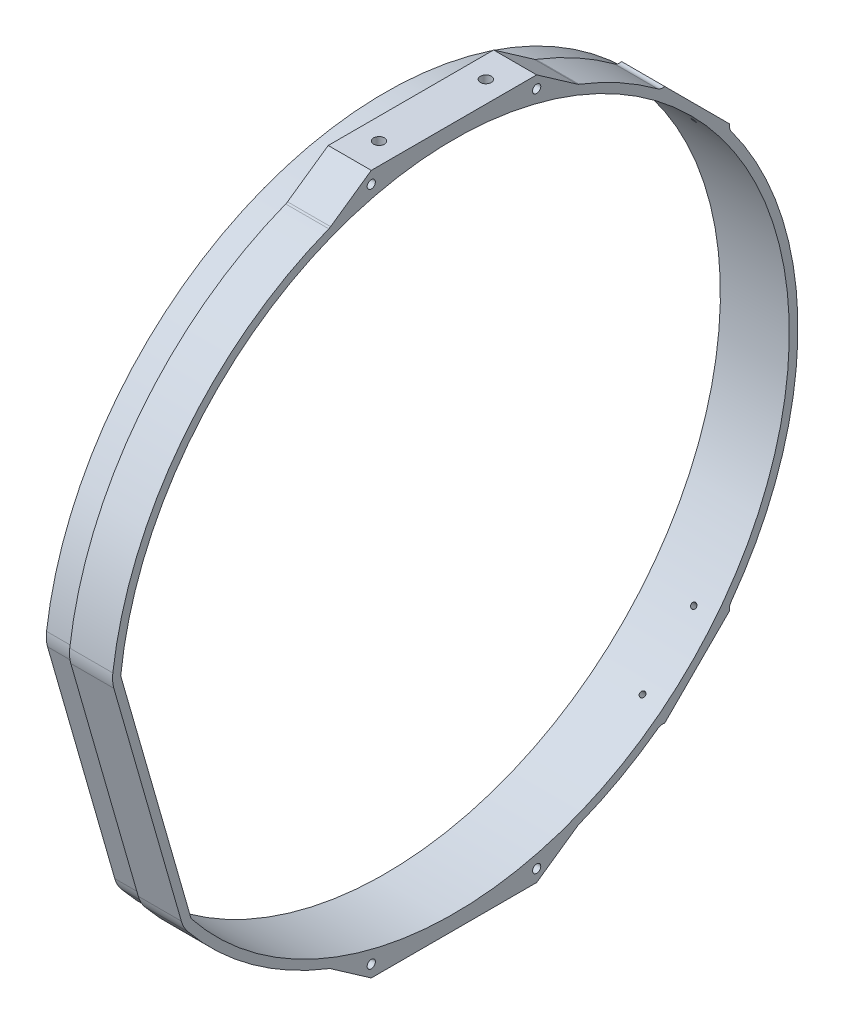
ISO-10303-21;
HEADER;
FILE_DESCRIPTION(('STEP AP214'),'2;1');
FILE_NAME('part.step','',(''),(''),'','','');
FILE_SCHEMA(('AUTOMOTIVE_DESIGN { 1 0 10303 214 1 1 1 1 }'));
ENDSEC;
DATA;
#1=APPLICATION_CONTEXT('core data for automotive mechanical design processes');
#2=APPLICATION_PROTOCOL_DEFINITION('international standard','automotive_design',2000,#1);
#3=PRODUCT_CONTEXT('',#1,'mechanical');
#4=PRODUCT('Part','Part','',(#3));
#5=PRODUCT_RELATED_PRODUCT_CATEGORY('part','',(#4));
#6=PRODUCT_DEFINITION_FORMATION('','',#4);
#7=PRODUCT_DEFINITION_CONTEXT('part definition',#1,'design');
#8=PRODUCT_DEFINITION('design','',#6,#7);
#9=PRODUCT_DEFINITION_SHAPE('','',#8);
#10=(LENGTH_UNIT() NAMED_UNIT(*) SI_UNIT(.MILLI.,.METRE.));
#11=(NAMED_UNIT(*) PLANE_ANGLE_UNIT() SI_UNIT($,.RADIAN.));
#12=(NAMED_UNIT(*) SI_UNIT($,.STERADIAN.) SOLID_ANGLE_UNIT());
#13=UNCERTAINTY_MEASURE_WITH_UNIT(LENGTH_MEASURE(1.E-05),#10,'distance_accuracy_value','');
#14=(GEOMETRIC_REPRESENTATION_CONTEXT(3) GLOBAL_UNCERTAINTY_ASSIGNED_CONTEXT((#13)) GLOBAL_UNIT_ASSIGNED_CONTEXT((#10,
#11,#12)) REPRESENTATION_CONTEXT('',''));
#15=CARTESIAN_POINT('',(0.,0.,0.));
#16=DIRECTION('',(0.,0.,1.));
#17=DIRECTION('',(1.,0.,0.));
#18=AXIS2_PLACEMENT_3D('',#15,#16,#17);
#19=CARTESIAN_POINT('',(0.,329.810038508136,-242.387764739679));
#20=DIRECTION('',(1.,0.,0.));
#21=DIRECTION('',(0.,0.,-1.));
#22=AXIS2_PLACEMENT_3D('',#19,#20,#21);
#23=PLANE('',#22);
#24=CARTESIAN_POINT('',(0.,-392.,-96.));
#25=DIRECTION('',(1.,0.,0.));
#26=DIRECTION('',(0.,0.,-1.));
#27=AXIS2_PLACEMENT_3D('',#24,#25,#26);
#28=CIRCLE('',#27,4.763);
#29=CARTESIAN_POINT('',(0.,-392.,-100.763));
#30=VERTEX_POINT('',#29);
#31=EDGE_CURVE('E758',#30,#30,#28,.T.);
#32=ORIENTED_EDGE('',*,*,#31,.T.);
#33=EDGE_LOOP('',(#32));
#34=FACE_BOUND('',#33,.T.);
#35=CARTESIAN_POINT('',(0.,-392.,96.));
#36=DIRECTION('',(1.,0.,0.));
#37=DIRECTION('',(0.,0.,-1.));
#38=AXIS2_PLACEMENT_3D('',#35,#36,#37);
#39=CIRCLE('',#38,4.763);
#40=CARTESIAN_POINT('',(0.,-392.,91.237));
#41=VERTEX_POINT('',#40);
#42=EDGE_CURVE('E754',#41,#41,#39,.T.);
#43=ORIENTED_EDGE('',*,*,#42,.T.);
#44=EDGE_LOOP('',(#43));
#45=FACE_BOUND('',#44,.T.);
#46=CARTESIAN_POINT('',(0.,392.,-96.));
#47=DIRECTION('',(1.,0.,0.));
#48=DIRECTION('',(0.,0.,-1.));
#49=AXIS2_PLACEMENT_3D('',#46,#47,#48);
#50=CIRCLE('',#49,4.763);
#51=CARTESIAN_POINT('',(0.,392.,-100.763));
#52=VERTEX_POINT('',#51);
#53=EDGE_CURVE('E749',#52,#52,#50,.T.);
#54=ORIENTED_EDGE('',*,*,#53,.T.);
#55=EDGE_LOOP('',(#54));
#56=FACE_BOUND('',#55,.T.);
#57=CARTESIAN_POINT('',(0.,392.,96.));
#58=DIRECTION('',(1.,0.,0.));
#59=DIRECTION('',(0.,0.,-1.));
#60=AXIS2_PLACEMENT_3D('',#57,#58,#59);
#61=CIRCLE('',#60,4.763);
#62=CARTESIAN_POINT('',(0.,392.,91.237));
#63=VERTEX_POINT('',#62);
#64=EDGE_CURVE('E255',#63,#63,#61,.T.);
#65=ORIENTED_EDGE('',*,*,#64,.T.);
#66=EDGE_LOOP('',(#65));
#67=FACE_BOUND('',#66,.T.);
#68=CARTESIAN_POINT('',(0.,0.,0.));
#69=DIRECTION('',(-1.,0.,0.));
#70=DIRECTION('',(0.,0.,1.));
#71=AXIS2_PLACEMENT_3D('',#68,#69,#70);
#72=CIRCLE('',#71,399.3);
#73=CARTESIAN_POINT('',(0.,-371.907818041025,145.344641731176));
#74=VERTEX_POINT('',#73);
#75=CARTESIAN_POINT('',(0.,-252.904166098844,308.998337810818));
#76=VERTEX_POINT('',#75);
#77=EDGE_CURVE('E375',#74,#76,#72,.T.);
#78=ORIENTED_EDGE('',*,*,#77,.T.);
#79=CARTESIAN_POINT('',(0.,-227.569413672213,278.044334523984));
#80=DIRECTION('',(1.,0.,0.));
#81=DIRECTION('',(0.,0.,-1.));
#82=AXIS2_PLACEMENT_3D('',#79,#80,#81);
#83=CIRCLE('',#82,40.);
#84=CARTESIAN_POINT('',(0.,-238.594907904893,316.494802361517));
#85=VERTEX_POINT('',#84);
#86=EDGE_CURVE('E576',#76,#85,#83,.F.);
#87=ORIENTED_EDGE('',*,*,#86,.T.);
#88=DIRECTION('',(0.,0.961261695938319,0.275637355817));
#89=VECTOR('',#88,1.);
#90=CARTESIAN_POINT('',(0.,-246.304756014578,314.284038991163));
#91=LINE('',#90,#89);
#92=CARTESIAN_POINT('',(0.,34.6232646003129,394.838852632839));
#93=VERTEX_POINT('',#92);
#94=EDGE_CURVE('E378',#85,#93,#91,.T.);
#95=ORIENTED_EDGE('',*,*,#94,.T.);
#96=CARTESIAN_POINT('',(0.,45.648758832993,356.388384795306));
#97=DIRECTION('',(1.,0.,0.));
#98=DIRECTION('',(0.,0.,-1.));
#99=AXIS2_PLACEMENT_3D('',#96,#97,#98);
#100=CIRCLE('',#99,40.);
#101=CARTESIAN_POINT('',(0.,50.7307247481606,396.064241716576));
#102=VERTEX_POINT('',#101);
#103=EDGE_CURVE('E574',#93,#102,#100,.F.);
#104=ORIENTED_EDGE('',*,*,#103,.T.);
#105=CARTESIAN_POINT('',(0.,0.,0.));
#106=DIRECTION('',(-1.,0.,0.));
#107=DIRECTION('',(0.,0.,1.));
#108=AXIS2_PLACEMENT_3D('',#105,#106,#107);
#109=CIRCLE('',#108,399.3);
#110=CARTESIAN_POINT('',(0.,371.907818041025,145.344641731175));
#111=VERTEX_POINT('',#110);
#112=EDGE_CURVE('E381',#102,#111,#109,.T.);
#113=ORIENTED_EDGE('',*,*,#112,.T.);
#114=CARTESIAN_POINT('',(0.,381.2218129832,148.984627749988));
#115=DIRECTION('',(1.,0.,0.));
#116=DIRECTION('',(0.,0.,-1.));
#117=AXIS2_PLACEMENT_3D('',#114,#115,#116);
#118=CIRCLE('',#117,10.);
#119=CARTESIAN_POINT('',(0.,373.020983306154,143.262181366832));
#120=VERTEX_POINT('',#119);
#121=EDGE_CURVE('E617',#111,#120,#118,.T.);
#122=ORIENTED_EDGE('',*,*,#121,.T.);
#123=DIRECTION('',(0.,0.572244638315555,-0.820082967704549));
#124=VECTOR('',#123,1.);
#125=CARTESIAN_POINT('',(0.,372.336333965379,144.243351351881));
#126=LINE('',#125,#124);
#127=CARTESIAN_POINT('',(0.,406.,96.));
#128=VERTEX_POINT('',#127);
#129=EDGE_CURVE('E383',#120,#128,#126,.T.);
#130=ORIENTED_EDGE('',*,*,#129,.T.);
#131=DIRECTION('',(0.,0.,-1.));
#132=VECTOR('',#131,1.);
#133=CARTESIAN_POINT('',(0.,406.,96.));
#134=LINE('',#133,#132);
#135=CARTESIAN_POINT('',(0.,406.,-96.));
#136=VERTEX_POINT('',#135);
#137=EDGE_CURVE('E385',#128,#136,#134,.T.);
#138=ORIENTED_EDGE('',*,*,#137,.T.);
#139=DIRECTION('',(0.,-0.572244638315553,-0.82008296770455));
#140=VECTOR('',#139,1.);
#141=CARTESIAN_POINT('',(0.,406.,-96.));
#142=LINE('',#141,#140);
#143=CARTESIAN_POINT('',(0.,373.020983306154,-143.262181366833));
#144=VERTEX_POINT('',#143);
#145=EDGE_CURVE('E388',#136,#144,#142,.T.);
#146=ORIENTED_EDGE('',*,*,#145,.T.);
#147=CARTESIAN_POINT('',(0.,381.221812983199,-148.984627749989));
#148=DIRECTION('',(1.,0.,0.));
#149=DIRECTION('',(0.,0.,-1.));
#150=AXIS2_PLACEMENT_3D('',#147,#148,#149);
#151=CIRCLE('',#150,10.);
#152=CARTESIAN_POINT('',(0.,371.907818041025,-145.344641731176));
#153=VERTEX_POINT('',#152);
#154=EDGE_CURVE('E612',#144,#153,#151,.T.);
#155=ORIENTED_EDGE('',*,*,#154,.T.);
#156=CARTESIAN_POINT('',(0.,0.,0.));
#157=DIRECTION('',(-1.,0.,0.));
#158=DIRECTION('',(0.,0.,1.));
#159=AXIS2_PLACEMENT_3D('',#156,#157,#158);
#160=CIRCLE('',#159,399.3);
#161=CARTESIAN_POINT('',(0.,321.752133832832,-236.465757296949));
#162=VERTEX_POINT('',#161);
#163=EDGE_CURVE('E297',#153,#162,#160,.T.);
#164=ORIENTED_EDGE('',*,*,#163,.T.);
#165=CARTESIAN_POINT('',(0.,329.810038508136,-242.387764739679));
#166=DIRECTION('',(1.,0.,0.));
#167=DIRECTION('',(0.,0.,-1.));
#168=AXIS2_PLACEMENT_3D('',#165,#166,#167);
#169=CIRCLE('',#168,9.99999999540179);
#170=CARTESIAN_POINT('',(0.,320.06481343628,-244.630662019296));
#171=VERTEX_POINT('',#170);
#172=EDGE_CURVE('E246',#162,#171,#169,.T.);
#173=ORIENTED_EDGE('',*,*,#172,.T.);
#174=DIRECTION('',(0.,-0.707106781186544,-0.707106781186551));
#175=VECTOR('',#174,1.);
#176=CARTESIAN_POINT('',(0.,320.06481343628,-244.630662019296));
#177=LINE('',#176,#175);
#178=CARTESIAN_POINT('',(0.,244.6306620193,-320.064813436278));
#179=VERTEX_POINT('',#178);
#180=EDGE_CURVE('E346',#171,#179,#177,.T.);
#181=ORIENTED_EDGE('',*,*,#180,.T.);
#182=CARTESIAN_POINT('',(0.,242.387764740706,-329.810038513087));
#183=DIRECTION('',(1.,0.,0.));
#184=DIRECTION('',(0.,0.,-1.));
#185=AXIS2_PLACEMENT_3D('',#182,#183,#184);
#186=CIRCLE('',#185,9.99999999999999);
#187=CARTESIAN_POINT('',(0.,236.465757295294,-321.752133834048));
#188=VERTEX_POINT('',#187);
#189=EDGE_CURVE('E349',#179,#188,#186,.T.);
#190=ORIENTED_EDGE('',*,*,#189,.T.);
#191=CARTESIAN_POINT('',(0.,0.,0.));
#192=DIRECTION('',(-1.,0.,0.));
#193=DIRECTION('',(0.,0.,1.));
#194=AXIS2_PLACEMENT_3D('',#191,#192,#193);
#195=CIRCLE('',#194,399.3);
#196=CARTESIAN_POINT('',(0.,-236.465757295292,-321.752133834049));
#197=VERTEX_POINT('',#196);
#198=EDGE_CURVE('E352',#188,#197,#195,.T.);
#199=ORIENTED_EDGE('',*,*,#198,.T.);
#200=CARTESIAN_POINT('',(0.,-242.387764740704,-329.810038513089));
#201=DIRECTION('',(1.,0.,0.));
#202=DIRECTION('',(0.,0.,-1.));
#203=AXIS2_PLACEMENT_3D('',#200,#201,#202);
#204=CIRCLE('',#203,10.0000000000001);
#205=CARTESIAN_POINT('',(0.,-244.630662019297,-320.064813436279));
#206=VERTEX_POINT('',#205);
#207=EDGE_CURVE('E355',#197,#206,#204,.T.);
#208=ORIENTED_EDGE('',*,*,#207,.T.);
#209=DIRECTION('',(0.,-0.707106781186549,0.707106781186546));
#210=VECTOR('',#209,1.);
#211=CARTESIAN_POINT('',(0.,-320.064813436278,-244.630662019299));
#212=LINE('',#211,#210);
#213=CARTESIAN_POINT('',(0.,-320.064813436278,-244.630662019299));
#214=VERTEX_POINT('',#213);
#215=EDGE_CURVE('E358',#206,#214,#212,.T.);
#216=ORIENTED_EDGE('',*,*,#215,.T.);
#217=CARTESIAN_POINT('',(0.,-329.810038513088,-242.387764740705));
#218=DIRECTION('',(1.,0.,0.));
#219=DIRECTION('',(0.,0.,-1.));
#220=AXIS2_PLACEMENT_3D('',#217,#218,#219);
#221=CIRCLE('',#220,10.);
#222=CARTESIAN_POINT('',(0.,-321.752133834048,-236.465757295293));
#223=VERTEX_POINT('',#222);
#224=EDGE_CURVE('E361',#214,#223,#221,.T.);
#225=ORIENTED_EDGE('',*,*,#224,.T.);
#226=CARTESIAN_POINT('',(0.,0.,0.));
#227=DIRECTION('',(-1.,0.,0.));
#228=DIRECTION('',(0.,0.,1.));
#229=AXIS2_PLACEMENT_3D('',#226,#227,#228);
#230=CIRCLE('',#229,399.3);
#231=CARTESIAN_POINT('',(0.,-371.907818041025,-145.344641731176));
#232=VERTEX_POINT('',#231);
#233=EDGE_CURVE('E364',#223,#232,#230,.T.);
#234=ORIENTED_EDGE('',*,*,#233,.T.);
#235=CARTESIAN_POINT('',(0.,-381.221812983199,-148.984627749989));
#236=DIRECTION('',(1.,0.,0.));
#237=DIRECTION('',(0.,0.,-1.));
#238=AXIS2_PLACEMENT_3D('',#235,#236,#237);
#239=CIRCLE('',#238,10.);
#240=CARTESIAN_POINT('',(0.,-373.020983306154,-143.262181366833));
#241=VERTEX_POINT('',#240);
#242=EDGE_CURVE('E608',#232,#241,#239,.T.);
#243=ORIENTED_EDGE('',*,*,#242,.T.);
#244=DIRECTION('',(0.,-0.572244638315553,0.82008296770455));
#245=VECTOR('',#244,1.);
#246=CARTESIAN_POINT('',(0.,-372.336333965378,-144.243351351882));
#247=LINE('',#246,#245);
#248=CARTESIAN_POINT('',(0.,-406.,-96.));
#249=VERTEX_POINT('',#248);
#250=EDGE_CURVE('E367',#241,#249,#247,.T.);
#251=ORIENTED_EDGE('',*,*,#250,.T.);
#252=DIRECTION('',(0.,0.,1.));
#253=VECTOR('',#252,1.);
#254=CARTESIAN_POINT('',(0.,-406.,-96.));
#255=LINE('',#254,#253);
#256=CARTESIAN_POINT('',(0.,-406.,96.));
#257=VERTEX_POINT('',#256);
#258=EDGE_CURVE('E369',#249,#257,#255,.T.);
#259=ORIENTED_EDGE('',*,*,#258,.T.);
#260=DIRECTION('',(0.,0.572244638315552,0.820082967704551));
#261=VECTOR('',#260,1.);
#262=CARTESIAN_POINT('',(0.,-406.,96.));
#263=LINE('',#262,#261);
#264=CARTESIAN_POINT('',(0.,-373.020983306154,143.262181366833));
#265=VERTEX_POINT('',#264);
#266=EDGE_CURVE('E372',#257,#265,#263,.T.);
#267=ORIENTED_EDGE('',*,*,#266,.T.);
#268=CARTESIAN_POINT('',(0.,-381.221812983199,148.984627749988));
#269=DIRECTION('',(1.,0.,0.));
#270=DIRECTION('',(0.,0.,-1.));
#271=AXIS2_PLACEMENT_3D('',#268,#269,#270);
#272=CIRCLE('',#271,10.);
#273=EDGE_CURVE('E602',#265,#74,#272,.T.);
#274=ORIENTED_EDGE('',*,*,#273,.T.);
#275=EDGE_LOOP('',(#78,#87,#95,#104,#113,#122,#130,#138,#146,#155,#164,#173,#181,#190,#199,#208,
#216,#225,#234,#243,#251,#259,#267,#274));
#276=FACE_BOUND('',#275,.T.);
#277=CARTESIAN_POINT('',(0.,0.,0.));
#278=DIRECTION('',(-1.,0.,0.));
#279=DIRECTION('',(0.,0.,1.));
#280=AXIS2_PLACEMENT_3D('',#277,#278,#279);
#281=CIRCLE('',#280,396.3);
#282=CARTESIAN_POINT('',(0.,51.0305106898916,393.000734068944));
#283=VERTEX_POINT('',#282);
#284=CARTESIAN_POINT('',(0.,-251.534987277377,306.241473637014));
#285=VERTEX_POINT('',#284);
#286=EDGE_CURVE('E252',#283,#285,#281,.T.);
#287=ORIENTED_EDGE('',*,*,#286,.F.);
#288=CARTESIAN_POINT('',(0.,45.8798156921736,353.333740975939));
#289=DIRECTION('',(1.,0.,0.));
#290=DIRECTION('',(0.,0.,-1.));
#291=AXIS2_PLACEMENT_3D('',#288,#289,#290);
#292=CIRCLE('',#291,40.);
#293=CARTESIAN_POINT('',(0.,34.8543214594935,391.784208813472));
#294=VERTEX_POINT('',#293);
#295=EDGE_CURVE('E11',#283,#294,#292,.T.);
#296=ORIENTED_EDGE('',*,*,#295,.T.);
#297=DIRECTION('',(0.,0.961261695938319,0.275637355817));
#298=VECTOR('',#297,1.);
#299=CARTESIAN_POINT('',(0.,-244.913949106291,311.561948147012));
#300=LINE('',#299,#298);
#301=CARTESIAN_POINT('',(0.,-237.172140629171,313.781876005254));
#302=VERTEX_POINT('',#301);
#303=EDGE_CURVE('E266',#302,#294,#300,.T.);
#304=ORIENTED_EDGE('',*,*,#303,.F.);
#305=CARTESIAN_POINT('',(0.,-226.146646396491,275.331408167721));
#306=DIRECTION('',(1.,0.,0.));
#307=DIRECTION('',(0.,0.,-1.));
#308=AXIS2_PLACEMENT_3D('',#305,#306,#307);
#309=CIRCLE('',#308,40.);
#310=EDGE_CURVE('E45',#302,#285,#309,.T.);
#311=ORIENTED_EDGE('',*,*,#310,.T.);
#312=EDGE_LOOP('',(#287,#296,#304,#311));
#313=FACE_BOUND('',#312,.T.);
#314=ADVANCED_FACE('F37',(#34,#45,#56,#67,#276,#313),#23,.F.);
#315=CARTESIAN_POINT('',(50.,329.810038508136,-242.387764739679));
#316=DIRECTION('',(-1.,0.,0.));
#317=DIRECTION('',(0.,0.,1.));
#318=AXIS2_PLACEMENT_3D('',#315,#316,#317);
#319=CYLINDRICAL_SURFACE('',#318,9.99999999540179);
#320=ORIENTED_EDGE('',*,*,#172,.F.);
#321=DIRECTION('',(-1.,0.,0.));
#322=VECTOR('',#321,1.);
#323=CARTESIAN_POINT('',(50.,321.752133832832,-236.465757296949));
#324=LINE('',#323,#322);
#325=CARTESIAN_POINT('',(50.,321.752133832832,-236.465757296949));
#326=VERTEX_POINT('',#325);
#327=EDGE_CURVE('E392',#326,#162,#324,.T.);
#328=ORIENTED_EDGE('',*,*,#327,.F.);
#329=CARTESIAN_POINT('',(50.,329.810038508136,-242.387764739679));
#330=DIRECTION('',(1.,0.,0.));
#331=DIRECTION('',(0.,0.,-1.));
#332=AXIS2_PLACEMENT_3D('',#329,#330,#331);
#333=CIRCLE('',#332,9.99999999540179);
#334=CARTESIAN_POINT('',(50.,320.06481343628,-244.630662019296));
#335=VERTEX_POINT('',#334);
#336=EDGE_CURVE('E293',#326,#335,#333,.T.);
#337=ORIENTED_EDGE('',*,*,#336,.T.);
#338=DIRECTION('',(-1.,0.,0.));
#339=VECTOR('',#338,1.);
#340=CARTESIAN_POINT('',(50.,320.06481343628,-244.630662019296));
#341=LINE('',#340,#339);
#342=EDGE_CURVE('E343',#335,#171,#341,.T.);
#343=ORIENTED_EDGE('',*,*,#342,.T.);
#344=EDGE_LOOP('',(#320,#328,#337,#343));
#345=FACE_BOUND('',#344,.T.);
#346=ADVANCED_FACE('F446',(#345),#319,.F.);
#347=CARTESIAN_POINT('',(50.,0.,0.));
#348=DIRECTION('',(-1.,0.,0.));
#349=DIRECTION('',(0.,0.,1.));
#350=AXIS2_PLACEMENT_3D('',#347,#348,#349);
#351=CYLINDRICAL_SURFACE('',#350,399.3);
#352=ORIENTED_EDGE('',*,*,#163,.F.);
#353=DIRECTION('',(-1.,0.,0.));
#354=VECTOR('',#353,1.);
#355=CARTESIAN_POINT('',(50.,371.907818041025,-145.344641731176));
#356=LINE('',#355,#354);
#357=CARTESIAN_POINT('',(50.,371.907818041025,-145.344641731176));
#358=VERTEX_POINT('',#357);
#359=EDGE_CURVE('E629',#153,#358,#356,.F.);
#360=ORIENTED_EDGE('',*,*,#359,.T.);
#361=CARTESIAN_POINT('',(50.,0.,0.));
#362=DIRECTION('',(-1.,0.,0.));
#363=DIRECTION('',(0.,0.,1.));
#364=AXIS2_PLACEMENT_3D('',#361,#362,#363);
#365=CIRCLE('',#364,399.3);
#366=EDGE_CURVE('E341',#358,#326,#365,.T.);
#367=ORIENTED_EDGE('',*,*,#366,.T.);
#368=ORIENTED_EDGE('',*,*,#327,.T.);
#369=EDGE_LOOP('',(#352,#360,#367,#368));
#370=FACE_BOUND('',#369,.T.);
#371=ADVANCED_FACE('F452',(#370),#351,.T.);
#372=CARTESIAN_POINT('',(50.,406.,-96.));
#373=DIRECTION('',(0.,0.82008296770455,-0.572244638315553));
#374=DIRECTION('',(0.,0.572244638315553,0.82008296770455));
#375=AXIS2_PLACEMENT_3D('',#372,#373,#374);
#376=PLANE('',#375);
#377=DIRECTION('',(0.,-0.572244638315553,-0.82008296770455));
#378=VECTOR('',#377,1.);
#379=CARTESIAN_POINT('',(50.,406.,-96.));
#380=LINE('',#379,#378);
#381=CARTESIAN_POINT('',(50.,406.,-96.));
#382=VERTEX_POINT('',#381);
#383=CARTESIAN_POINT('',(50.,373.020983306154,-143.262181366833));
#384=VERTEX_POINT('',#383);
#385=EDGE_CURVE('E338',#382,#384,#380,.T.);
#386=ORIENTED_EDGE('',*,*,#385,.T.);
#387=DIRECTION('',(1.,0.,0.));
#388=VECTOR('',#387,1.);
#389=CARTESIAN_POINT('',(0.,373.020983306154,-143.262181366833));
#390=LINE('',#389,#388);
#391=EDGE_CURVE('E631',#384,#144,#390,.F.);
#392=ORIENTED_EDGE('',*,*,#391,.T.);
#393=ORIENTED_EDGE('',*,*,#145,.F.);
#394=DIRECTION('',(-1.,0.,0.));
#395=VECTOR('',#394,1.);
#396=CARTESIAN_POINT('',(50.,406.,-96.));
#397=LINE('',#396,#395);
#398=EDGE_CURVE('E396',#382,#136,#397,.T.);
#399=ORIENTED_EDGE('',*,*,#398,.F.);
#400=EDGE_LOOP('',(#386,#392,#393,#399));
#401=FACE_BOUND('',#400,.T.);
#402=ADVANCED_FACE('F460',(#401),#376,.T.);
#403=CARTESIAN_POINT('',(50.,406.,96.));
#404=DIRECTION('',(0.,1.,0.));
#405=DIRECTION('',(0.,0.,1.));
#406=AXIS2_PLACEMENT_3D('',#403,#404,#405);
#407=PLANE('',#406);
#408=CARTESIAN_POINT('',(25.,406.,62.));
#409=DIRECTION('',(0.,1.,0.));
#410=DIRECTION('',(0.,0.,1.));
#411=AXIS2_PLACEMENT_3D('',#408,#409,#410);
#412=CIRCLE('',#411,6.35);
#413=CARTESIAN_POINT('',(25.,406.,68.35));
#414=VERTEX_POINT('',#413);
#415=EDGE_CURVE('E768',#414,#414,#412,.T.);
#416=ORIENTED_EDGE('',*,*,#415,.F.);
#417=EDGE_LOOP('',(#416));
#418=FACE_BOUND('',#417,.T.);
#419=CARTESIAN_POINT('',(25.,406.,-62.));
#420=DIRECTION('',(0.,1.,0.));
#421=DIRECTION('',(0.,0.,1.));
#422=AXIS2_PLACEMENT_3D('',#419,#420,#421);
#423=CIRCLE('',#422,6.35);
#424=CARTESIAN_POINT('',(25.,406.,-55.65));
#425=VERTEX_POINT('',#424);
#426=EDGE_CURVE('E762',#425,#425,#423,.T.);
#427=ORIENTED_EDGE('',*,*,#426,.F.);
#428=EDGE_LOOP('',(#427));
#429=FACE_BOUND('',#428,.T.);
#430=ORIENTED_EDGE('',*,*,#137,.F.);
#431=DIRECTION('',(-1.,0.,0.));
#432=VECTOR('',#431,1.);
#433=CARTESIAN_POINT('',(50.,406.,96.));
#434=LINE('',#433,#432);
#435=CARTESIAN_POINT('',(50.,406.,96.));
#436=VERTEX_POINT('',#435);
#437=EDGE_CURVE('E398',#436,#128,#434,.T.);
#438=ORIENTED_EDGE('',*,*,#437,.F.);
#439=DIRECTION('',(0.,0.,-1.));
#440=VECTOR('',#439,1.);
#441=CARTESIAN_POINT('',(50.,406.,96.));
#442=LINE('',#441,#440);
#443=EDGE_CURVE('E335',#436,#382,#442,.T.);
#444=ORIENTED_EDGE('',*,*,#443,.T.);
#445=ORIENTED_EDGE('',*,*,#398,.T.);
#446=EDGE_LOOP('',(#430,#438,#444,#445));
#447=FACE_BOUND('',#446,.T.);
#448=ADVANCED_FACE('F464',(#418,#429,#447),#407,.T.);
#449=CARTESIAN_POINT('',(50.,372.336333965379,144.243351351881));
#450=DIRECTION('',(0.,0.820082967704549,0.572244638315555));
#451=DIRECTION('',(0.,-0.572244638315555,0.820082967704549));
#452=AXIS2_PLACEMENT_3D('',#449,#450,#451);
#453=PLANE('',#452);
#454=ORIENTED_EDGE('',*,*,#129,.F.);
#455=DIRECTION('',(1.,0.,0.));
#456=VECTOR('',#455,1.);
#457=CARTESIAN_POINT('',(50.,373.020983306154,143.262181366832));
#458=LINE('',#457,#456);
#459=CARTESIAN_POINT('',(50.,373.020983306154,143.262181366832));
#460=VERTEX_POINT('',#459);
#461=EDGE_CURVE('E634',#120,#460,#458,.T.);
#462=ORIENTED_EDGE('',*,*,#461,.T.);
#463=DIRECTION('',(0.,0.572244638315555,-0.820082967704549));
#464=VECTOR('',#463,1.);
#465=CARTESIAN_POINT('',(50.,372.336333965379,144.243351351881));
#466=LINE('',#465,#464);
#467=EDGE_CURVE('E333',#460,#436,#466,.T.);
#468=ORIENTED_EDGE('',*,*,#467,.T.);
#469=ORIENTED_EDGE('',*,*,#437,.T.);
#470=EDGE_LOOP('',(#454,#462,#468,#469));
#471=FACE_BOUND('',#470,.T.);
#472=ADVANCED_FACE('F468',(#471),#453,.T.);
#473=CARTESIAN_POINT('',(50.,0.,0.));
#474=DIRECTION('',(-1.,0.,0.));
#475=DIRECTION('',(0.,0.,1.));
#476=AXIS2_PLACEMENT_3D('',#473,#474,#475);
#477=CYLINDRICAL_SURFACE('',#476,399.3);
#478=ORIENTED_EDGE('',*,*,#112,.F.);
#479=DIRECTION('',(-1.,0.,0.));
#480=VECTOR('',#479,1.);
#481=CARTESIAN_POINT('',(50.,50.7307247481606,396.064241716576));
#482=LINE('',#481,#480);
#483=CARTESIAN_POINT('',(50.,50.7307247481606,396.064241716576));
#484=VERTEX_POINT('',#483);
#485=EDGE_CURVE('E52',#102,#484,#482,.F.);
#486=ORIENTED_EDGE('',*,*,#485,.T.);
#487=CARTESIAN_POINT('',(50.,0.,0.));
#488=DIRECTION('',(-1.,0.,0.));
#489=DIRECTION('',(0.,0.,1.));
#490=AXIS2_PLACEMENT_3D('',#487,#488,#489);
#491=CIRCLE('',#490,399.3);
#492=CARTESIAN_POINT('',(50.,371.907818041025,145.344641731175));
#493=VERTEX_POINT('',#492);
#494=EDGE_CURVE('E331',#484,#493,#491,.T.);
#495=ORIENTED_EDGE('',*,*,#494,.T.);
#496=DIRECTION('',(-1.,0.,0.));
#497=VECTOR('',#496,1.);
#498=CARTESIAN_POINT('',(50.,371.907818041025,145.344641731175));
#499=LINE('',#498,#497);
#500=EDGE_CURVE('E395',#493,#111,#499,.T.);
#501=ORIENTED_EDGE('',*,*,#500,.T.);
#502=EDGE_LOOP('',(#478,#486,#495,#501));
#503=FACE_BOUND('',#502,.T.);
#504=ADVANCED_FACE('F472',(#503),#477,.T.);
#505=CARTESIAN_POINT('',(50.,-246.304756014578,314.284038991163));
#506=DIRECTION('',(0.,-0.275637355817,0.961261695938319));
#507=DIRECTION('',(0.,-0.961261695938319,-0.275637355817));
#508=AXIS2_PLACEMENT_3D('',#505,#506,#507);
#509=PLANE('',#508);
#510=ORIENTED_EDGE('',*,*,#94,.F.);
#511=DIRECTION('',(-1.,0.,0.));
#512=VECTOR('',#511,1.);
#513=CARTESIAN_POINT('',(50.,-238.594907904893,316.494802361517));
#514=LINE('',#513,#512);
#515=CARTESIAN_POINT('',(50.,-238.594907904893,316.494802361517));
#516=VERTEX_POINT('',#515);
#517=EDGE_CURVE('E581',#85,#516,#514,.F.);
#518=ORIENTED_EDGE('',*,*,#517,.T.);
#519=DIRECTION('',(0.,0.961261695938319,0.275637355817));
#520=VECTOR('',#519,1.);
#521=CARTESIAN_POINT('',(50.,-246.304756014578,314.284038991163));
#522=LINE('',#521,#520);
#523=CARTESIAN_POINT('',(50.,34.6232646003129,394.838852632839));
#524=VERTEX_POINT('',#523);
#525=EDGE_CURVE('E329',#516,#524,#522,.T.);
#526=ORIENTED_EDGE('',*,*,#525,.T.);
#527=DIRECTION('',(-1.,0.,0.));
#528=VECTOR('',#527,1.);
#529=CARTESIAN_POINT('',(50.,34.623264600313,394.838852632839));
#530=LINE('',#529,#528);
#531=EDGE_CURVE('E578',#524,#93,#530,.T.);
#532=ORIENTED_EDGE('',*,*,#531,.T.);
#533=EDGE_LOOP('',(#510,#518,#526,#532));
#534=FACE_BOUND('',#533,.T.);
#535=ADVANCED_FACE('F476',(#534),#509,.T.);
#536=CARTESIAN_POINT('',(50.,0.,0.));
#537=DIRECTION('',(-1.,0.,0.));
#538=DIRECTION('',(0.,0.,1.));
#539=AXIS2_PLACEMENT_3D('',#536,#537,#538);
#540=CYLINDRICAL_SURFACE('',#539,399.3);
#541=CARTESIAN_POINT('',(50.,0.,0.));
#542=DIRECTION('',(-1.,0.,0.));
#543=DIRECTION('',(0.,0.,1.));
#544=AXIS2_PLACEMENT_3D('',#541,#542,#543);
#545=CIRCLE('',#544,399.3);
#546=CARTESIAN_POINT('',(50.,-371.907818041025,145.344641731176));
#547=VERTEX_POINT('',#546);
#548=CARTESIAN_POINT('',(50.,-252.904166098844,308.998337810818));
#549=VERTEX_POINT('',#548);
#550=EDGE_CURVE('E326',#547,#549,#545,.T.);
#551=ORIENTED_EDGE('',*,*,#550,.T.);
#552=DIRECTION('',(-1.,0.,0.));
#553=VECTOR('',#552,1.);
#554=CARTESIAN_POINT('',(50.,-252.904166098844,308.998337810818));
#555=LINE('',#554,#553);
#556=EDGE_CURVE('E567',#549,#76,#555,.T.);
#557=ORIENTED_EDGE('',*,*,#556,.T.);
#558=ORIENTED_EDGE('',*,*,#77,.F.);
#559=DIRECTION('',(-1.,0.,0.));
#560=VECTOR('',#559,1.);
#561=CARTESIAN_POINT('',(50.,-371.907818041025,145.344641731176));
#562=LINE('',#561,#560);
#563=EDGE_CURVE('E619',#74,#547,#562,.F.);
#564=ORIENTED_EDGE('',*,*,#563,.T.);
#565=EDGE_LOOP('',(#551,#557,#558,#564));
#566=FACE_BOUND('',#565,.T.);
#567=ADVANCED_FACE('F479',(#566),#540,.T.);
#568=CARTESIAN_POINT('',(50.,-406.,96.));
#569=DIRECTION('',(0.,-0.820082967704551,0.572244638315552));
#570=DIRECTION('',(0.,-0.572244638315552,-0.820082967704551));
#571=AXIS2_PLACEMENT_3D('',#568,#569,#570);
#572=PLANE('',#571);
#573=DIRECTION('',(0.,0.572244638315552,0.820082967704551));
#574=VECTOR('',#573,1.);
#575=CARTESIAN_POINT('',(50.,-406.,96.));
#576=LINE('',#575,#574);
#577=CARTESIAN_POINT('',(50.,-406.,96.));
#578=VERTEX_POINT('',#577);
#579=CARTESIAN_POINT('',(50.,-373.020983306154,143.262181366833));
#580=VERTEX_POINT('',#579);
#581=EDGE_CURVE('E323',#578,#580,#576,.T.);
#582=ORIENTED_EDGE('',*,*,#581,.T.);
#583=DIRECTION('',(1.,0.,0.));
#584=VECTOR('',#583,1.);
#585=CARTESIAN_POINT('',(0.,-373.020983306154,143.262181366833));
#586=LINE('',#585,#584);
#587=EDGE_CURVE('E621',#580,#265,#586,.F.);
#588=ORIENTED_EDGE('',*,*,#587,.T.);
#589=ORIENTED_EDGE('',*,*,#266,.F.);
#590=DIRECTION('',(-1.,0.,0.));
#591=VECTOR('',#590,1.);
#592=CARTESIAN_POINT('',(50.,-406.,96.));
#593=LINE('',#592,#591);
#594=EDGE_CURVE('E401',#578,#257,#593,.T.);
#595=ORIENTED_EDGE('',*,*,#594,.F.);
#596=EDGE_LOOP('',(#582,#588,#589,#595));
#597=FACE_BOUND('',#596,.T.);
#598=ADVANCED_FACE('F483',(#597),#572,.T.);
#599=CARTESIAN_POINT('',(50.,-406.,-96.));
#600=DIRECTION('',(0.,-1.,0.));
#601=DIRECTION('',(0.,0.,-1.));
#602=AXIS2_PLACEMENT_3D('',#599,#600,#601);
#603=PLANE('',#602);
#604=CARTESIAN_POINT('',(25.,-406.,-62.));
#605=DIRECTION('',(0.,-1.,0.));
#606=DIRECTION('',(0.,0.,-1.));
#607=AXIS2_PLACEMENT_3D('',#604,#605,#606);
#608=CIRCLE('',#607,6.35);
#609=CARTESIAN_POINT('',(25.,-406.,-68.35));
#610=VERTEX_POINT('',#609);
#611=EDGE_CURVE('E780',#610,#610,#608,.T.);
#612=ORIENTED_EDGE('',*,*,#611,.F.);
#613=EDGE_LOOP('',(#612));
#614=FACE_BOUND('',#613,.T.);
#615=CARTESIAN_POINT('',(25.,-406.,62.));
#616=DIRECTION('',(0.,-1.,0.));
#617=DIRECTION('',(0.,0.,-1.));
#618=AXIS2_PLACEMENT_3D('',#615,#616,#617);
#619=CIRCLE('',#618,6.35);
#620=CARTESIAN_POINT('',(25.,-406.,55.65));
#621=VERTEX_POINT('',#620);
#622=EDGE_CURVE('E774',#621,#621,#619,.T.);
#623=ORIENTED_EDGE('',*,*,#622,.F.);
#624=EDGE_LOOP('',(#623));
#625=FACE_BOUND('',#624,.T.);
#626=ORIENTED_EDGE('',*,*,#258,.F.);
#627=DIRECTION('',(-1.,0.,0.));
#628=VECTOR('',#627,1.);
#629=CARTESIAN_POINT('',(50.,-406.,-96.));
#630=LINE('',#629,#628);
#631=CARTESIAN_POINT('',(50.,-406.,-96.));
#632=VERTEX_POINT('',#631);
#633=EDGE_CURVE('E403',#632,#249,#630,.T.);
#634=ORIENTED_EDGE('',*,*,#633,.F.);
#635=DIRECTION('',(0.,0.,1.));
#636=VECTOR('',#635,1.);
#637=CARTESIAN_POINT('',(50.,-406.,-96.));
#638=LINE('',#637,#636);
#639=EDGE_CURVE('E320',#632,#578,#638,.T.);
#640=ORIENTED_EDGE('',*,*,#639,.T.);
#641=ORIENTED_EDGE('',*,*,#594,.T.);
#642=EDGE_LOOP('',(#626,#634,#640,#641));
#643=FACE_BOUND('',#642,.T.);
#644=ADVANCED_FACE('F487',(#614,#625,#643),#603,.T.);
#645=CARTESIAN_POINT('',(50.,-372.336333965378,-144.243351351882));
#646=DIRECTION('',(0.,-0.82008296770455,-0.572244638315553));
#647=DIRECTION('',(0.,0.572244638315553,-0.82008296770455));
#648=AXIS2_PLACEMENT_3D('',#645,#646,#647);
#649=PLANE('',#648);
#650=ORIENTED_EDGE('',*,*,#250,.F.);
#651=DIRECTION('',(1.,0.,0.));
#652=VECTOR('',#651,1.);
#653=CARTESIAN_POINT('',(50.,-373.020983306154,-143.262181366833));
#654=LINE('',#653,#652);
#655=CARTESIAN_POINT('',(50.,-373.020983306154,-143.262181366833));
#656=VERTEX_POINT('',#655);
#657=EDGE_CURVE('E624',#241,#656,#654,.T.);
#658=ORIENTED_EDGE('',*,*,#657,.T.);
#659=DIRECTION('',(0.,-0.572244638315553,0.82008296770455));
#660=VECTOR('',#659,1.);
#661=CARTESIAN_POINT('',(50.,-372.336333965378,-144.243351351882));
#662=LINE('',#661,#660);
#663=EDGE_CURVE('E318',#656,#632,#662,.T.);
#664=ORIENTED_EDGE('',*,*,#663,.T.);
#665=ORIENTED_EDGE('',*,*,#633,.T.);
#666=EDGE_LOOP('',(#650,#658,#664,#665));
#667=FACE_BOUND('',#666,.T.);
#668=ADVANCED_FACE('F491',(#667),#649,.T.);
#669=CARTESIAN_POINT('',(50.,0.,0.));
#670=DIRECTION('',(-1.,0.,0.));
#671=DIRECTION('',(0.,0.,1.));
#672=AXIS2_PLACEMENT_3D('',#669,#670,#671);
#673=CYLINDRICAL_SURFACE('',#672,399.3);
#674=CARTESIAN_POINT('',(50.,0.,0.));
#675=DIRECTION('',(-1.,0.,0.));
#676=DIRECTION('',(0.,0.,1.));
#677=AXIS2_PLACEMENT_3D('',#674,#675,#676);
#678=CIRCLE('',#677,399.3);
#679=CARTESIAN_POINT('',(50.,-321.752133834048,-236.465757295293));
#680=VERTEX_POINT('',#679);
#681=CARTESIAN_POINT('',(50.,-371.907818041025,-145.344641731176));
#682=VERTEX_POINT('',#681);
#683=EDGE_CURVE('E315',#680,#682,#678,.T.);
#684=ORIENTED_EDGE('',*,*,#683,.T.);
#685=DIRECTION('',(-1.,0.,0.));
#686=VECTOR('',#685,1.);
#687=CARTESIAN_POINT('',(50.,-371.907818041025,-145.344641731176));
#688=LINE('',#687,#686);
#689=EDGE_CURVE('E626',#682,#232,#688,.T.);
#690=ORIENTED_EDGE('',*,*,#689,.T.);
#691=ORIENTED_EDGE('',*,*,#233,.F.);
#692=DIRECTION('',(-1.,0.,0.));
#693=VECTOR('',#692,1.);
#694=CARTESIAN_POINT('',(50.,-321.752133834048,-236.465757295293));
#695=LINE('',#694,#693);
#696=EDGE_CURVE('E406',#680,#223,#695,.T.);
#697=ORIENTED_EDGE('',*,*,#696,.F.);
#698=EDGE_LOOP('',(#684,#690,#691,#697));
#699=FACE_BOUND('',#698,.T.);
#700=ADVANCED_FACE('F495',(#699),#673,.T.);
#701=CARTESIAN_POINT('',(50.,-329.810038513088,-242.387764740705));
#702=DIRECTION('',(-1.,0.,0.));
#703=DIRECTION('',(0.,0.,1.));
#704=AXIS2_PLACEMENT_3D('',#701,#702,#703);
#705=CYLINDRICAL_SURFACE('',#704,10.);
#706=ORIENTED_EDGE('',*,*,#224,.F.);
#707=DIRECTION('',(-1.,0.,0.));
#708=VECTOR('',#707,1.);
#709=CARTESIAN_POINT('',(50.,-320.064813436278,-244.630662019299));
#710=LINE('',#709,#708);
#711=CARTESIAN_POINT('',(50.,-320.064813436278,-244.630662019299));
#712=VERTEX_POINT('',#711);
#713=EDGE_CURVE('E408',#712,#214,#710,.T.);
#714=ORIENTED_EDGE('',*,*,#713,.F.);
#715=CARTESIAN_POINT('',(50.,-329.810038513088,-242.387764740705));
#716=DIRECTION('',(1.,0.,0.));
#717=DIRECTION('',(0.,0.,-1.));
#718=AXIS2_PLACEMENT_3D('',#715,#716,#717);
#719=CIRCLE('',#718,10.);
#720=EDGE_CURVE('E312',#712,#680,#719,.T.);
#721=ORIENTED_EDGE('',*,*,#720,.T.);
#722=ORIENTED_EDGE('',*,*,#696,.T.);
#723=EDGE_LOOP('',(#706,#714,#721,#722));
#724=FACE_BOUND('',#723,.T.);
#725=ADVANCED_FACE('F499',(#724),#705,.F.);
#726=CARTESIAN_POINT('',(50.,-320.064813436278,-244.630662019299));
#727=DIRECTION('',(0.,-0.707106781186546,-0.707106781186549));
#728=DIRECTION('',(0.,0.707106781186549,-0.707106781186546));
#729=AXIS2_PLACEMENT_3D('',#726,#727,#728);
#730=PLANE('',#729);
#731=CARTESIAN_POINT('',(25.,-252.649252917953,-312.046222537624));
#732=DIRECTION('',(0.,-0.707106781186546,-0.707106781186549));
#733=DIRECTION('',(0.,0.707106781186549,-0.707106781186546));
#734=AXIS2_PLACEMENT_3D('',#731,#732,#733);
#735=CIRCLE('',#734,3.17500000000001);
#736=CARTESIAN_POINT('',(25.,-250.404188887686,-314.291286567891));
#737=VERTEX_POINT('',#736);
#738=EDGE_CURVE('E269',#737,#737,#735,.T.);
#739=ORIENTED_EDGE('',*,*,#738,.F.);
#740=EDGE_LOOP('',(#739));
#741=FACE_BOUND('',#740,.T.);
#742=CARTESIAN_POINT('',(25.,-312.046222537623,-252.649252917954));
#743=DIRECTION('',(0.,-0.707106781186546,-0.707106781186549));
#744=DIRECTION('',(0.,0.707106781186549,-0.707106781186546));
#745=AXIS2_PLACEMENT_3D('',#742,#743,#744);
#746=CIRCLE('',#745,3.17500000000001);
#747=CARTESIAN_POINT('',(25.,-309.801158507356,-254.894316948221));
#748=VERTEX_POINT('',#747);
#749=EDGE_CURVE('E277',#748,#748,#746,.T.);
#750=ORIENTED_EDGE('',*,*,#749,.F.);
#751=EDGE_LOOP('',(#750));
#752=FACE_BOUND('',#751,.T.);
#753=ORIENTED_EDGE('',*,*,#215,.F.);
#754=DIRECTION('',(-1.,0.,0.));
#755=VECTOR('',#754,1.);
#756=CARTESIAN_POINT('',(50.,-244.630662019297,-320.064813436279));
#757=LINE('',#756,#755);
#758=CARTESIAN_POINT('',(50.,-244.630662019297,-320.064813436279));
#759=VERTEX_POINT('',#758);
#760=EDGE_CURVE('E410',#759,#206,#757,.T.);
#761=ORIENTED_EDGE('',*,*,#760,.F.);
#762=DIRECTION('',(0.,-0.707106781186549,0.707106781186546));
#763=VECTOR('',#762,1.);
#764=CARTESIAN_POINT('',(50.,-320.064813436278,-244.630662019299));
#765=LINE('',#764,#763);
#766=EDGE_CURVE('E309',#759,#712,#765,.T.);
#767=ORIENTED_EDGE('',*,*,#766,.T.);
#768=ORIENTED_EDGE('',*,*,#713,.T.);
#769=EDGE_LOOP('',(#753,#761,#767,#768));
#770=FACE_BOUND('',#769,.T.);
#771=ADVANCED_FACE('F503',(#741,#752,#770),#730,.T.);
#772=CARTESIAN_POINT('',(50.,-242.387764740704,-329.810038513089));
#773=DIRECTION('',(-1.,0.,0.));
#774=DIRECTION('',(0.,0.,1.));
#775=AXIS2_PLACEMENT_3D('',#772,#773,#774);
#776=CYLINDRICAL_SURFACE('',#775,10.0000000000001);
#777=ORIENTED_EDGE('',*,*,#207,.F.);
#778=DIRECTION('',(-1.,0.,0.));
#779=VECTOR('',#778,1.);
#780=CARTESIAN_POINT('',(50.,-236.465757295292,-321.752133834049));
#781=LINE('',#780,#779);
#782=CARTESIAN_POINT('',(50.,-236.465757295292,-321.752133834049));
#783=VERTEX_POINT('',#782);
#784=EDGE_CURVE('E412',#783,#197,#781,.T.);
#785=ORIENTED_EDGE('',*,*,#784,.F.);
#786=CARTESIAN_POINT('',(50.,-242.387764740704,-329.810038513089));
#787=DIRECTION('',(1.,0.,0.));
#788=DIRECTION('',(0.,0.,-1.));
#789=AXIS2_PLACEMENT_3D('',#786,#787,#788);
#790=CIRCLE('',#789,10.0000000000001);
#791=EDGE_CURVE('E306',#783,#759,#790,.T.);
#792=ORIENTED_EDGE('',*,*,#791,.T.);
#793=ORIENTED_EDGE('',*,*,#760,.T.);
#794=EDGE_LOOP('',(#777,#785,#792,#793));
#795=FACE_BOUND('',#794,.T.);
#796=ADVANCED_FACE('F507',(#795),#776,.F.);
#797=CARTESIAN_POINT('',(50.,0.,0.));
#798=DIRECTION('',(-1.,0.,0.));
#799=DIRECTION('',(0.,0.,1.));
#800=AXIS2_PLACEMENT_3D('',#797,#798,#799);
#801=CYLINDRICAL_SURFACE('',#800,399.3);
#802=ORIENTED_EDGE('',*,*,#198,.F.);
#803=DIRECTION('',(-1.,0.,0.));
#804=VECTOR('',#803,1.);
#805=CARTESIAN_POINT('',(50.,236.465757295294,-321.752133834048));
#806=LINE('',#805,#804);
#807=CARTESIAN_POINT('',(50.,236.465757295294,-321.752133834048));
#808=VERTEX_POINT('',#807);
#809=EDGE_CURVE('E414',#808,#188,#806,.T.);
#810=ORIENTED_EDGE('',*,*,#809,.F.);
#811=CARTESIAN_POINT('',(50.,0.,0.));
#812=DIRECTION('',(-1.,0.,0.));
#813=DIRECTION('',(0.,0.,1.));
#814=AXIS2_PLACEMENT_3D('',#811,#812,#813);
#815=CIRCLE('',#814,399.3);
#816=EDGE_CURVE('E303',#808,#783,#815,.T.);
#817=ORIENTED_EDGE('',*,*,#816,.T.);
#818=ORIENTED_EDGE('',*,*,#784,.T.);
#819=EDGE_LOOP('',(#802,#810,#817,#818));
#820=FACE_BOUND('',#819,.T.);
#821=ADVANCED_FACE('F511',(#820),#801,.T.);
#822=CARTESIAN_POINT('',(50.,242.387764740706,-329.810038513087));
#823=DIRECTION('',(-1.,0.,0.));
#824=DIRECTION('',(0.,0.,1.));
#825=AXIS2_PLACEMENT_3D('',#822,#823,#824);
#826=CYLINDRICAL_SURFACE('',#825,9.99999999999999);
#827=ORIENTED_EDGE('',*,*,#189,.F.);
#828=DIRECTION('',(-1.,0.,0.));
#829=VECTOR('',#828,1.);
#830=CARTESIAN_POINT('',(50.,244.6306620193,-320.064813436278));
#831=LINE('',#830,#829);
#832=CARTESIAN_POINT('',(50.,244.6306620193,-320.064813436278));
#833=VERTEX_POINT('',#832);
#834=EDGE_CURVE('E416',#833,#179,#831,.T.);
#835=ORIENTED_EDGE('',*,*,#834,.F.);
#836=CARTESIAN_POINT('',(50.,242.387764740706,-329.810038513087));
#837=DIRECTION('',(1.,0.,0.));
#838=DIRECTION('',(0.,0.,-1.));
#839=AXIS2_PLACEMENT_3D('',#836,#837,#838);
#840=CIRCLE('',#839,9.99999999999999);
#841=EDGE_CURVE('E300',#833,#808,#840,.T.);
#842=ORIENTED_EDGE('',*,*,#841,.T.);
#843=ORIENTED_EDGE('',*,*,#809,.T.);
#844=EDGE_LOOP('',(#827,#835,#842,#843));
#845=FACE_BOUND('',#844,.T.);
#846=ADVANCED_FACE('F515',(#845),#826,.F.);
#847=CARTESIAN_POINT('',(50.,320.06481343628,-244.630662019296));
#848=DIRECTION('',(0.,0.707106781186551,-0.707106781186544));
#849=DIRECTION('',(0.,0.707106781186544,0.707106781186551));
#850=AXIS2_PLACEMENT_3D('',#847,#848,#849);
#851=PLANE('',#850);
#852=CARTESIAN_POINT('',(25.,312.046222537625,-252.649252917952));
#853=DIRECTION('',(0.,0.707106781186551,-0.707106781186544));
#854=DIRECTION('',(0.,0.707106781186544,0.707106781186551));
#855=AXIS2_PLACEMENT_3D('',#852,#853,#854);
#856=CIRCLE('',#855,3.175);
#857=CARTESIAN_POINT('',(25.,314.291286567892,-250.404188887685));
#858=VERTEX_POINT('',#857);
#859=EDGE_CURVE('E281',#858,#858,#856,.T.);
#860=ORIENTED_EDGE('',*,*,#859,.F.);
#861=EDGE_LOOP('',(#860));
#862=FACE_BOUND('',#861,.T.);
#863=CARTESIAN_POINT('',(25.,252.649252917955,-312.046222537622));
#864=DIRECTION('',(0.,0.707106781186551,-0.707106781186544));
#865=DIRECTION('',(0.,0.707106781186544,0.707106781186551));
#866=AXIS2_PLACEMENT_3D('',#863,#864,#865);
#867=CIRCLE('',#866,3.175);
#868=CARTESIAN_POINT('',(25.,254.894316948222,-309.801158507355));
#869=VERTEX_POINT('',#868);
#870=EDGE_CURVE('E285',#869,#869,#867,.T.);
#871=ORIENTED_EDGE('',*,*,#870,.F.);
#872=EDGE_LOOP('',(#871));
#873=FACE_BOUND('',#872,.T.);
#874=ORIENTED_EDGE('',*,*,#180,.F.);
#875=ORIENTED_EDGE('',*,*,#342,.F.);
#876=DIRECTION('',(0.,-0.707106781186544,-0.707106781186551));
#877=VECTOR('',#876,1.);
#878=CARTESIAN_POINT('',(50.,320.06481343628,-244.630662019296));
#879=LINE('',#878,#877);
#880=EDGE_CURVE('E296',#335,#833,#879,.T.);
#881=ORIENTED_EDGE('',*,*,#880,.T.);
#882=ORIENTED_EDGE('',*,*,#834,.T.);
#883=EDGE_LOOP('',(#874,#875,#881,#882));
#884=FACE_BOUND('',#883,.T.);
#885=ADVANCED_FACE('F519',(#862,#873,#884),#851,.T.);
#886=CARTESIAN_POINT('',(50.,329.810038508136,-242.387764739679));
#887=DIRECTION('',(1.,0.,0.));
#888=DIRECTION('',(0.,0.,-1.));
#889=AXIS2_PLACEMENT_3D('',#886,#887,#888);
#890=PLANE('',#889);
#891=CARTESIAN_POINT('',(50.,-392.,-96.));
#892=DIRECTION('',(1.,0.,0.));
#893=DIRECTION('',(0.,0.,-1.));
#894=AXIS2_PLACEMENT_3D('',#891,#892,#893);
#895=CIRCLE('',#894,4.763);
#896=CARTESIAN_POINT('',(50.,-392.,-100.763));
#897=VERTEX_POINT('',#896);
#898=EDGE_CURVE('E736',#897,#897,#895,.T.);
#899=ORIENTED_EDGE('',*,*,#898,.F.);
#900=EDGE_LOOP('',(#899));
#901=FACE_BOUND('',#900,.T.);
#902=CARTESIAN_POINT('',(50.,-392.,96.));
#903=DIRECTION('',(1.,0.,0.));
#904=DIRECTION('',(0.,0.,-1.));
#905=AXIS2_PLACEMENT_3D('',#902,#903,#904);
#906=CIRCLE('',#905,4.763);
#907=CARTESIAN_POINT('',(50.,-392.,91.237));
#908=VERTEX_POINT('',#907);
#909=EDGE_CURVE('E740',#908,#908,#906,.T.);
#910=ORIENTED_EDGE('',*,*,#909,.F.);
#911=EDGE_LOOP('',(#910));
#912=FACE_BOUND('',#911,.T.);
#913=CARTESIAN_POINT('',(50.,392.,-96.));
#914=DIRECTION('',(1.,0.,0.));
#915=DIRECTION('',(0.,0.,-1.));
#916=AXIS2_PLACEMENT_3D('',#913,#914,#915);
#917=CIRCLE('',#916,4.763);
#918=CARTESIAN_POINT('',(50.,392.,-100.763));
#919=VERTEX_POINT('',#918);
#920=EDGE_CURVE('E744',#919,#919,#917,.T.);
#921=ORIENTED_EDGE('',*,*,#920,.F.);
#922=EDGE_LOOP('',(#921));
#923=FACE_BOUND('',#922,.T.);
#924=CARTESIAN_POINT('',(50.,392.,96.));
#925=DIRECTION('',(1.,0.,0.));
#926=DIRECTION('',(0.,0.,-1.));
#927=AXIS2_PLACEMENT_3D('',#924,#925,#926);
#928=CIRCLE('',#927,4.763);
#929=CARTESIAN_POINT('',(50.,392.,91.237));
#930=VERTEX_POINT('',#929);
#931=EDGE_CURVE('E258',#930,#930,#928,.T.);
#932=ORIENTED_EDGE('',*,*,#931,.F.);
#933=EDGE_LOOP('',(#932));
#934=FACE_BOUND('',#933,.T.);
#935=CARTESIAN_POINT('',(50.,0.,0.));
#936=DIRECTION('',(-1.,0.,0.));
#937=DIRECTION('',(0.,0.,1.));
#938=AXIS2_PLACEMENT_3D('',#935,#936,#937);
#939=CIRCLE('',#938,389.3);
#940=CARTESIAN_POINT('',(50.,43.2011550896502,386.895528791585));
#941=VERTEX_POINT('',#940);
#942=CARTESIAN_POINT('',(50.,-241.66005127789,305.212892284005));
#943=VERTEX_POINT('',#942);
#944=EDGE_CURVE('E242',#941,#943,#939,.T.);
#945=ORIENTED_EDGE('',*,*,#944,.T.);
#946=DIRECTION('',(0.,0.961261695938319,0.275637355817));
#947=VECTOR('',#946,1.);
#948=CARTESIAN_POINT('',(50.,-241.66005127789,305.212892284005));
#949=LINE('',#948,#947);
#950=EDGE_CURVE('E290',#943,#941,#949,.T.);
#951=ORIENTED_EDGE('',*,*,#950,.T.);
#952=EDGE_LOOP('',(#945,#951));
#953=FACE_BOUND('',#952,.T.);
#954=ORIENTED_EDGE('',*,*,#525,.F.);
#955=CARTESIAN_POINT('',(50.,-227.569413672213,278.044334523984));
#956=DIRECTION('',(1.,0.,0.));
#957=DIRECTION('',(0.,0.,-1.));
#958=AXIS2_PLACEMENT_3D('',#955,#956,#957);
#959=CIRCLE('',#958,40.);
#960=EDGE_CURVE('E584',#516,#549,#959,.T.);
#961=ORIENTED_EDGE('',*,*,#960,.T.);
#962=ORIENTED_EDGE('',*,*,#550,.F.);
#963=CARTESIAN_POINT('',(50.,-381.221812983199,148.984627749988));
#964=DIRECTION('',(1.,0.,0.));
#965=DIRECTION('',(0.,0.,-1.));
#966=AXIS2_PLACEMENT_3D('',#963,#964,#965);
#967=CIRCLE('',#966,10.);
#968=EDGE_CURVE('E599',#547,#580,#967,.F.);
#969=ORIENTED_EDGE('',*,*,#968,.T.);
#970=ORIENTED_EDGE('',*,*,#581,.F.);
#971=ORIENTED_EDGE('',*,*,#639,.F.);
#972=ORIENTED_EDGE('',*,*,#663,.F.);
#973=CARTESIAN_POINT('',(50.,-381.221812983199,-148.984627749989));
#974=DIRECTION('',(1.,0.,0.));
#975=DIRECTION('',(0.,0.,-1.));
#976=AXIS2_PLACEMENT_3D('',#973,#974,#975);
#977=CIRCLE('',#976,10.);
#978=EDGE_CURVE('E606',#656,#682,#977,.F.);
#979=ORIENTED_EDGE('',*,*,#978,.T.);
#980=ORIENTED_EDGE('',*,*,#683,.F.);
#981=ORIENTED_EDGE('',*,*,#720,.F.);
#982=ORIENTED_EDGE('',*,*,#766,.F.);
#983=ORIENTED_EDGE('',*,*,#791,.F.);
#984=ORIENTED_EDGE('',*,*,#816,.F.);
#985=ORIENTED_EDGE('',*,*,#841,.F.);
#986=ORIENTED_EDGE('',*,*,#880,.F.);
#987=ORIENTED_EDGE('',*,*,#336,.F.);
#988=ORIENTED_EDGE('',*,*,#366,.F.);
#989=CARTESIAN_POINT('',(50.,381.221812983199,-148.984627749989));
#990=DIRECTION('',(1.,0.,0.));
#991=DIRECTION('',(0.,0.,-1.));
#992=AXIS2_PLACEMENT_3D('',#989,#990,#991);
#993=CIRCLE('',#992,10.);
#994=EDGE_CURVE('E610',#358,#384,#993,.F.);
#995=ORIENTED_EDGE('',*,*,#994,.T.);
#996=ORIENTED_EDGE('',*,*,#385,.F.);
#997=ORIENTED_EDGE('',*,*,#443,.F.);
#998=ORIENTED_EDGE('',*,*,#467,.F.);
#999=CARTESIAN_POINT('',(50.,381.2218129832,148.984627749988));
#1000=DIRECTION('',(1.,0.,0.));
#1001=DIRECTION('',(0.,0.,-1.));
#1002=AXIS2_PLACEMENT_3D('',#999,#1000,#1001);
#1003=CIRCLE('',#1002,10.);
#1004=EDGE_CURVE('E614',#460,#493,#1003,.F.);
#1005=ORIENTED_EDGE('',*,*,#1004,.T.);
#1006=ORIENTED_EDGE('',*,*,#494,.F.);
#1007=CARTESIAN_POINT('',(50.,45.648758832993,356.388384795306));
#1008=DIRECTION('',(1.,0.,0.));
#1009=DIRECTION('',(0.,0.,-1.));
#1010=AXIS2_PLACEMENT_3D('',#1007,#1008,#1009);
#1011=CIRCLE('',#1010,40.);
#1012=EDGE_CURVE('E59',#484,#524,#1011,.T.);
#1013=ORIENTED_EDGE('',*,*,#1012,.T.);
#1014=EDGE_LOOP('',(#954,#961,#962,#969,#970,#971,#972,#979,#980,#981,#982,#983,#984,#985,#986,
#987,#988,#995,#996,#997,#998,#1005,#1006,#1013));
#1015=FACE_BOUND('',#1014,.T.);
#1016=ADVANCED_FACE('F443',(#901,#912,#923,#934,#953,#1015),#890,.T.);
#1017=CARTESIAN_POINT('',(50.,0.,0.));
#1018=DIRECTION('',(-1.,0.,0.));
#1019=DIRECTION('',(0.,0.,1.));
#1020=AXIS2_PLACEMENT_3D('',#1017,#1018,#1019);
#1021=CYLINDRICAL_SURFACE('',#1020,389.3);
#1022=CARTESIAN_POINT('',(25.,-241.473448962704,-305.360546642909));
#1023=CARTESIAN_POINT('',(25.1774643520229,-241.47345537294,-305.360541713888));
#1024=CARTESIAN_POINT('',(25.355057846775,-241.485240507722,-305.35122325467));
#1025=CARTESIAN_POINT('',(25.7053367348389,-241.532068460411,-305.314183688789));
#1026=CARTESIAN_POINT('',(25.8780159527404,-241.567139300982,-305.286440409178));
#1027=CARTESIAN_POINT('',(26.2133233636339,-241.659472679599,-305.213356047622));
#1028=CARTESIAN_POINT('',(26.3759577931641,-241.716721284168,-305.168026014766));
#1029=CARTESIAN_POINT('',(26.68666527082,-241.851691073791,-305.061070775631));
#1030=CARTESIAN_POINT('',(26.8347417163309,-241.929407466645,-304.999449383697));
#1031=CARTESIAN_POINT('',(27.1127222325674,-242.103317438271,-304.861420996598));
#1032=CARTESIAN_POINT('',(27.2425662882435,-242.199569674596,-304.784967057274));
#1033=CARTESIAN_POINT('',(27.4799383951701,-242.407593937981,-304.619543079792));
#1034=CARTESIAN_POINT('',(27.5874648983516,-242.519367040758,-304.530572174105));
#1035=CARTESIAN_POINT('',(27.77785932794,-242.75597244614,-304.341996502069));
#1036=CARTESIAN_POINT('',(27.860568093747,-242.880882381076,-304.242328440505));
#1037=CARTESIAN_POINT('',(27.9981477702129,-243.139604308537,-304.035606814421));
#1038=CARTESIAN_POINT('',(28.0530178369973,-243.273416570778,-303.928553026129));
#1039=CARTESIAN_POINT('',(28.1336354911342,-243.546886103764,-303.709458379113));
#1040=CARTESIAN_POINT('',(28.15922690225,-243.686570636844,-303.597394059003));
#1041=CARTESIAN_POINT('',(28.180048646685,-243.967152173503,-303.371968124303));
#1042=CARTESIAN_POINT('',(28.1752785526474,-244.108049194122,-303.258606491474));
#1043=CARTESIAN_POINT('',(28.1354534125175,-244.387348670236,-303.033572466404));
#1044=CARTESIAN_POINT('',(28.1003388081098,-244.525745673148,-302.921903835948));
#1045=CARTESIAN_POINT('',(28.0006972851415,-244.795829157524,-302.703687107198));
#1046=CARTESIAN_POINT('',(27.9361704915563,-244.927515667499,-302.59713898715));
#1047=CARTESIAN_POINT('',(27.7796348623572,-245.180184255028,-302.392449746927));
#1048=CARTESIAN_POINT('',(27.6876787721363,-245.301186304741,-302.294292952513));
#1049=CARTESIAN_POINT('',(27.4788004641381,-245.529311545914,-302.109034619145));
#1050=CARTESIAN_POINT('',(27.3618788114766,-245.636435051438,-302.021932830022));
#1051=CARTESIAN_POINT('',(27.1069521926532,-245.833272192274,-301.861737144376));
#1052=CARTESIAN_POINT('',(26.9690460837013,-245.92306320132,-301.788581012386));
#1053=CARTESIAN_POINT('',(26.6756617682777,-246.083264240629,-301.657964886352));
#1054=CARTESIAN_POINT('',(26.5201840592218,-246.153674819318,-301.600504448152));
#1055=CARTESIAN_POINT('',(26.196930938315,-246.272774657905,-301.50326096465));
#1056=CARTESIAN_POINT('',(26.0292228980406,-246.321573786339,-301.463388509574));
#1057=CARTESIAN_POINT('',(25.6855848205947,-246.396575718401,-301.402089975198));
#1058=CARTESIAN_POINT('',(25.5096549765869,-246.422779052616,-301.380663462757));
#1059=CARTESIAN_POINT('',(25.1552712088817,-246.451780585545,-301.356948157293));
#1060=CARTESIAN_POINT('',(24.9768291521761,-246.454665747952,-301.354588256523));
#1061=CARTESIAN_POINT('',(24.6218587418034,-246.437177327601,-301.368889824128));
#1062=CARTESIAN_POINT('',(24.4453303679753,-246.416803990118,-301.385551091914));
#1063=CARTESIAN_POINT('',(24.0993882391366,-246.353416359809,-301.437366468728));
#1064=CARTESIAN_POINT('',(23.9299671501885,-246.310426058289,-301.472500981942));
#1065=CARTESIAN_POINT('',(23.6028251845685,-246.203044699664,-301.560202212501));
#1066=CARTESIAN_POINT('',(23.4451043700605,-246.138653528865,-301.612769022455));
#1067=CARTESIAN_POINT('',(23.1454965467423,-245.990152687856,-301.733895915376));
#1068=CARTESIAN_POINT('',(23.0036407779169,-245.906005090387,-301.802486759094));
#1069=CARTESIAN_POINT('',(22.7400707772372,-245.720440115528,-301.953588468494));
#1070=CARTESIAN_POINT('',(22.6183569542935,-245.619022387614,-302.03609961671));
#1071=CARTESIAN_POINT('',(22.3979553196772,-245.401297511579,-302.2130257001));
#1072=CARTESIAN_POINT('',(22.2993688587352,-245.284928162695,-302.307490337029));
#1073=CARTESIAN_POINT('',(22.1286072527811,-245.040917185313,-302.505311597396));
#1074=CARTESIAN_POINT('',(22.0564328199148,-244.913275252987,-302.608668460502));
#1075=CARTESIAN_POINT('',(21.9401542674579,-244.649604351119,-302.82187826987));
#1076=CARTESIAN_POINT('',(21.8961976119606,-244.513535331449,-302.931762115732));
#1077=CARTESIAN_POINT('',(21.8381393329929,-244.237438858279,-303.154407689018));
#1078=CARTESIAN_POINT('',(21.8240385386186,-244.097411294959,-303.267169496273));
#1079=CARTESIAN_POINT('',(21.8260674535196,-243.816767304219,-303.492844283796));
#1080=CARTESIAN_POINT('',(21.8423187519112,-243.676150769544,-303.605756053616));
#1081=CARTESIAN_POINT('',(21.9048348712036,-243.398880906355,-303.828086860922));
#1082=CARTESIAN_POINT('',(21.951100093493,-243.262227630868,-303.937505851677));
#1083=CARTESIAN_POINT('',(22.0724229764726,-242.996662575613,-304.149865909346));
#1084=CARTESIAN_POINT('',(22.1475072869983,-242.867758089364,-304.252800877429));
#1085=CARTESIAN_POINT('',(22.324382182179,-242.6215592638,-304.44916456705));
#1086=CARTESIAN_POINT('',(22.4261714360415,-242.504264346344,-304.542593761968));
#1087=CARTESIAN_POINT('',(22.6532551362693,-242.28505906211,-304.717015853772));
#1088=CARTESIAN_POINT('',(22.7784747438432,-242.183101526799,-304.798046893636));
#1089=CARTESIAN_POINT('',(23.049153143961,-241.997123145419,-304.945727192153));
#1090=CARTESIAN_POINT('',(23.194616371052,-241.913106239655,-305.012373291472));
#1091=CARTESIAN_POINT('',(23.500762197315,-241.765968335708,-305.129014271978));
#1092=CARTESIAN_POINT('',(23.6613577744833,-241.70273624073,-305.1790976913));
#1093=CARTESIAN_POINT('',(23.9937419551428,-241.598508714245,-305.261617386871));
#1094=CARTESIAN_POINT('',(24.1655162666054,-241.557485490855,-305.29407571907));
#1095=CARTESIAN_POINT('',(24.4486880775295,-241.50998397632,-305.331652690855));
#1096=CARTESIAN_POINT('',(24.5582044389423,-241.496301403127,-305.34247419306));
#1097=CARTESIAN_POINT('',(24.7784637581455,-241.478031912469,-305.35692269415));
#1098=CARTESIAN_POINT('',(24.8892067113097,-241.473444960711,-305.360549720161));
#1099=CARTESIAN_POINT('',(25.,-241.473448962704,-305.360546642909));
#1100=B_SPLINE_CURVE_WITH_KNOTS('',3,(#1022,#1023,#1024,#1025,#1026,#1027,#1028,#1029,#1030,
#1031,#1032,#1033,#1034,#1035,#1036,#1037,#1038,#1039,#1040,#1041,#1042,#1043,#1044,#1045,#1046,
#1047,#1048,#1049,#1050,#1051,#1052,#1053,#1054,#1055,#1056,#1057,#1058,#1059,#1060,#1061,#1062,
#1063,#1064,#1065,#1066,#1067,#1068,#1069,#1070,#1071,#1072,#1073,#1074,#1075,#1076,#1077,#1078,
#1079,#1080,#1081,#1082,#1083,#1084,#1085,#1086,#1087,#1088,#1089,#1090,#1091,#1092,#1093,#1094,
#1095,#1096,#1097,#1098,#1099),.UNSPECIFIED.,.T.,.F.,(4,2,2,2,2,2,2,2,2,2,2,2,2,2,2,2,2,2,2,2,2,
2,2,2,2,2,2,2,2,2,2,2,2,2,2,2,2,2,4),(0.,0.531987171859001,1.06461571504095,1.59691016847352,
2.12908010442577,2.66296264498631,3.19688220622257,3.73415609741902,4.27144627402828,
4.81158925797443,5.35173984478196,5.8929530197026,6.43416389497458,6.97434068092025,
7.51450524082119,8.0521996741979,8.58987889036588,9.12479235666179,9.65969326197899,
10.1925983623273,10.7254978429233,11.2578331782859,11.7901713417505,12.3235399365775,
12.8569193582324,13.3925942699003,13.9282836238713,14.4667501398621,15.0052316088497,
15.5458748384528,16.0865252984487,16.6276769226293,17.1688015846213,17.7082264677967,
18.2477697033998,18.7843802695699,19.3203177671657,19.6524454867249,19.9845719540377),.UNSPECIFIED.);
#1101=CARTESIAN_POINT('',(25.,-241.473448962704,-305.360546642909));
#1102=VERTEX_POINT('',#1101);
#1103=EDGE_CURVE('E276',#1102,#1102,#1100,.T.);
#1104=ORIENTED_EDGE('',*,*,#1103,.T.);
#1105=EDGE_LOOP('',(#1104));
#1106=FACE_BOUND('',#1105,.T.);
#1107=CARTESIAN_POINT('',(25.,-301.357700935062,-246.450859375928));
#1108=CARTESIAN_POINT('',(25.1776660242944,-301.35770609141,-246.450853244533));
#1109=CARTESIAN_POINT('',(25.3554611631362,-301.367222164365,-246.439218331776));
#1110=CARTESIAN_POINT('',(25.7061436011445,-301.405035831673,-246.392969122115));
#1111=CARTESIAN_POINT('',(25.8790247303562,-301.433356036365,-246.358327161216));
#1112=CARTESIAN_POINT('',(26.2147361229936,-301.507922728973,-246.267062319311));
#1113=CARTESIAN_POINT('',(26.3775721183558,-301.554158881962,-246.210452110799));
#1114=CARTESIAN_POINT('',(26.6886503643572,-301.663169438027,-246.076877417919));
#1115=CARTESIAN_POINT('',(26.8368961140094,-301.725939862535,-245.999917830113));
#1116=CARTESIAN_POINT('',(27.1150105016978,-301.866328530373,-245.827626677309));
#1117=CARTESIAN_POINT('',(27.2448379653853,-301.943979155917,-245.732255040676));
#1118=CARTESIAN_POINT('',(27.4821269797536,-302.111770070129,-245.525937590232));
#1119=CARTESIAN_POINT('',(27.5895871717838,-302.201911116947,-245.414990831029));
#1120=CARTESIAN_POINT('',(27.7796375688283,-302.392531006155,-245.180076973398));
#1121=CARTESIAN_POINT('',(27.8621070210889,-302.493056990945,-245.056050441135));
#1122=CARTESIAN_POINT('',(27.9992272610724,-302.701197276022,-244.798902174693));
#1123=CARTESIAN_POINT('',(28.0538772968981,-302.808811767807,-244.665780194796));
#1124=CARTESIAN_POINT('',(28.1340841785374,-303.028628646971,-244.393475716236));
#1125=CARTESIAN_POINT('',(28.1594926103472,-303.140851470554,-244.254265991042));
#1126=CARTESIAN_POINT('',(28.1800362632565,-303.36618721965,-243.974340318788));
#1127=CARTESIAN_POINT('',(28.1751708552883,-303.479300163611,-243.833624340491));
#1128=CARTESIAN_POINT('',(28.1352469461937,-303.703593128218,-243.554202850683));
#1129=CARTESIAN_POINT('',(28.1000912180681,-303.814765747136,-243.41550527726));
#1130=CARTESIAN_POINT('',(28.0004301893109,-304.031663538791,-243.144540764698));
#1131=CARTESIAN_POINT('',(27.9359247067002,-304.137388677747,-243.012273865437));
#1132=CARTESIAN_POINT('',(27.7793728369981,-304.3403731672,-242.758014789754));
#1133=CARTESIAN_POINT('',(27.6873351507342,-304.43763517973,-242.636019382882));
#1134=CARTESIAN_POINT('',(27.4782700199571,-304.620970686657,-242.405808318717));
#1135=CARTESIAN_POINT('',(27.3612430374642,-304.707044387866,-242.297592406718));
#1136=CARTESIAN_POINT('',(27.1060177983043,-304.865212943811,-242.098550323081));
#1137=CARTESIAN_POINT('',(26.9679093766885,-304.937364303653,-242.007653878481));
#1138=CARTESIAN_POINT('',(26.6740649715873,-305.066061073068,-241.845403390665));
#1139=CARTESIAN_POINT('',(26.5183296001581,-305.122607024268,-241.774048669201));
#1140=CARTESIAN_POINT('',(26.1947026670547,-305.218153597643,-241.653418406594));
#1141=CARTESIAN_POINT('',(26.0268938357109,-305.257262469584,-241.6040066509));
#1142=CARTESIAN_POINT('',(25.683045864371,-305.317323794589,-241.528102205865));
#1143=CARTESIAN_POINT('',(25.5070070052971,-305.338276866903,-241.501608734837));
#1144=CARTESIAN_POINT('',(25.1527085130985,-305.361356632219,-241.472425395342));
#1145=CARTESIAN_POINT('',(24.9744658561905,-305.363583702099,-241.469608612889));
#1146=CARTESIAN_POINT('',(24.61991796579,-305.349411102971,-241.487530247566));
#1147=CARTESIAN_POINT('',(24.4436127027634,-305.333011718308,-241.508268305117));
#1148=CARTESIAN_POINT('',(24.0982349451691,-305.282100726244,-241.572619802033));
#1149=CARTESIAN_POINT('',(23.929151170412,-305.247618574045,-241.616196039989));
#1150=CARTESIAN_POINT('',(23.6026726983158,-305.161544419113,-241.724898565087));
#1151=CARTESIAN_POINT('',(23.4452781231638,-305.109952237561,-241.790025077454));
#1152=CARTESIAN_POINT('',(23.146124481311,-304.990941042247,-241.940126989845));
#1153=CARTESIAN_POINT('',(23.0044130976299,-304.923475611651,-242.025160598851));
#1154=CARTESIAN_POINT('',(22.7410884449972,-304.774700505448,-242.212481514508));
#1155=CARTESIAN_POINT('',(22.6194757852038,-304.693390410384,-242.314769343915));
#1156=CARTESIAN_POINT('',(22.3990227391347,-304.518670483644,-242.534304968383));
#1157=CARTESIAN_POINT('',(22.3003223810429,-304.42519143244,-242.65163828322));
#1158=CARTESIAN_POINT('',(22.1293334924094,-304.229125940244,-242.897413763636));
#1159=CARTESIAN_POINT('',(22.0570458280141,-304.126539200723,-243.025856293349));
#1160=CARTESIAN_POINT('',(21.9405056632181,-303.914478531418,-243.290995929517));
#1161=CARTESIAN_POINT('',(21.8964220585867,-303.804967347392,-243.427737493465));
#1162=CARTESIAN_POINT('',(21.8381868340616,-303.582682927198,-243.704895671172));
#1163=CARTESIAN_POINT('',(21.8240359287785,-303.469909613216,-243.84531237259));
#1164=CARTESIAN_POINT('',(21.8260693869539,-303.243915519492,-244.126299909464));
#1165=CARTESIAN_POINT('',(21.8423496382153,-303.130694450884,-244.266869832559));
#1166=CARTESIAN_POINT('',(21.9050026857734,-302.907386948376,-244.543731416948));
#1167=CARTESIAN_POINT('',(21.9513755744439,-302.797300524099,-244.680023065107));
#1168=CARTESIAN_POINT('',(22.0729010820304,-302.583510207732,-244.944357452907));
#1169=CARTESIAN_POINT('',(22.1480322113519,-302.479801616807,-245.072406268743));
#1170=CARTESIAN_POINT('',(22.3249948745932,-302.281700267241,-245.316710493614));
#1171=CARTESIAN_POINT('',(22.4268248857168,-302.187306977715,-245.432966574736));
#1172=CARTESIAN_POINT('',(22.6538677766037,-302.010973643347,-245.649916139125));
#1173=CARTESIAN_POINT('',(22.7789841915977,-301.92898466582,-245.750670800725));
#1174=CARTESIAN_POINT('',(23.0493867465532,-301.779416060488,-245.934316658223));
#1175=CARTESIAN_POINT('',(23.1946773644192,-301.71183964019,-246.017203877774));
#1176=CARTESIAN_POINT('',(23.5005180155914,-301.593432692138,-246.162345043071));
#1177=CARTESIAN_POINT('',(23.6609927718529,-301.542524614,-246.224694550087));
#1178=CARTESIAN_POINT('',(23.9930927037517,-301.458594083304,-246.327445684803));
#1179=CARTESIAN_POINT('',(24.1647038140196,-301.425549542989,-246.367874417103));
#1180=CARTESIAN_POINT('',(24.4478640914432,-301.387223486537,-246.414756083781));
#1181=CARTESIAN_POINT('',(24.5575445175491,-301.376167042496,-246.428277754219));
#1182=CARTESIAN_POINT('',(24.7781331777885,-301.361404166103,-246.446331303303));
#1183=CARTESIAN_POINT('',(24.889041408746,-301.357697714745,-246.450863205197));
#1184=CARTESIAN_POINT('',(25.,-301.357700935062,-246.450859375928));
#1185=B_SPLINE_CURVE_WITH_KNOTS('',3,(#1107,#1108,#1109,#1110,#1111,#1112,#1113,#1114,#1115,
#1116,#1117,#1118,#1119,#1120,#1121,#1122,#1123,#1124,#1125,#1126,#1127,#1128,#1129,#1130,#1131,
#1132,#1133,#1134,#1135,#1136,#1137,#1138,#1139,#1140,#1141,#1142,#1143,#1144,#1145,#1146,#1147,
#1148,#1149,#1150,#1151,#1152,#1153,#1154,#1155,#1156,#1157,#1158,#1159,#1160,#1161,#1162,#1163,
#1164,#1165,#1166,#1167,#1168,#1169,#1170,#1171,#1172,#1173,#1174,#1175,#1176,#1177,#1178,#1179,
#1180,#1181,#1182,#1183,#1184),.UNSPECIFIED.,.T.,.F.,(4,2,2,2,2,2,2,2,2,2,2,2,2,2,2,2,2,2,2,2,2,
2,2,2,2,2,2,2,2,2,2,2,2,2,2,2,2,2,4),(0.,0.532592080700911,1.06582571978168,1.59875221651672,
2.13155059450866,2.66552189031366,3.19952561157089,3.73606988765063,4.27262866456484,
4.81189886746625,5.35118027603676,5.89219916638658,6.43322141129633,6.9740728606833,
7.51491431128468,8.05351227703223,8.59209154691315,9.12727909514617,9.66244838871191,
10.1947471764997,10.727037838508,11.2584641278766,11.789895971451,12.3229015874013,
12.8559233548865,13.392121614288,13.9283374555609,14.4677350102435,15.0071454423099,
15.54825840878,16.089373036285,16.6300841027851,17.170764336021,17.709252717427,
18.2478608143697,18.7839261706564,19.3193271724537,19.6519502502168,19.9845724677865),.UNSPECIFIED.);
#1186=CARTESIAN_POINT('',(25.,-301.357700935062,-246.450859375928));
#1187=VERTEX_POINT('',#1186);
#1188=EDGE_CURVE('E280',#1187,#1187,#1185,.T.);
#1189=ORIENTED_EDGE('',*,*,#1188,.T.);
#1190=EDGE_LOOP('',(#1189));
#1191=FACE_BOUND('',#1190,.T.);
#1192=CARTESIAN_POINT('',(25.,305.36054664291,-241.473448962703));
#1193=CARTESIAN_POINT('',(25.1774643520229,305.360541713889,-241.473455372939));
#1194=CARTESIAN_POINT('',(25.355057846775,305.35122325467,-241.485240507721));
#1195=CARTESIAN_POINT('',(25.7053367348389,305.31418368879,-241.53206846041));
#1196=CARTESIAN_POINT('',(25.8780159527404,305.286440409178,-241.567139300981));
#1197=CARTESIAN_POINT('',(26.2133233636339,305.213356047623,-241.659472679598));
#1198=CARTESIAN_POINT('',(26.3759577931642,305.168026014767,-241.716721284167));
#1199=CARTESIAN_POINT('',(26.68666527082,305.061070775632,-241.85169107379));
#1200=CARTESIAN_POINT('',(26.8347417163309,304.999449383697,-241.929407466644));
#1201=CARTESIAN_POINT('',(27.1127222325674,304.861420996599,-242.10331743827));
#1202=CARTESIAN_POINT('',(27.2425662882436,304.784967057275,-242.199569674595));
#1203=CARTESIAN_POINT('',(27.4799383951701,304.619543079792,-242.40759393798));
#1204=CARTESIAN_POINT('',(27.5874648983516,304.530572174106,-242.519367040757));
#1205=CARTESIAN_POINT('',(27.77785932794,304.34199650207,-242.755972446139));
#1206=CARTESIAN_POINT('',(27.860568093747,304.242328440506,-242.880882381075));
#1207=CARTESIAN_POINT('',(27.9981477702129,304.035606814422,-243.139604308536));
#1208=CARTESIAN_POINT('',(28.0530178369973,303.92855302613,-243.273416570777));
#1209=CARTESIAN_POINT('',(28.1336354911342,303.709458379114,-243.546886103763));
#1210=CARTESIAN_POINT('',(28.15922690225,303.597394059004,-243.686570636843));
#1211=CARTESIAN_POINT('',(28.180048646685,303.371968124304,-243.967152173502));
#1212=CARTESIAN_POINT('',(28.1752785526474,303.258606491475,-244.108049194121));
#1213=CARTESIAN_POINT('',(28.1354534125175,303.033572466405,-244.387348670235));
#1214=CARTESIAN_POINT('',(28.1003388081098,302.921903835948,-244.525745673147));
#1215=CARTESIAN_POINT('',(28.0006972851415,302.703687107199,-244.795829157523));
#1216=CARTESIAN_POINT('',(27.9361704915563,302.597138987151,-244.927515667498));
#1217=CARTESIAN_POINT('',(27.7796348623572,302.392449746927,-245.180184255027));
#1218=CARTESIAN_POINT('',(27.6876787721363,302.294292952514,-245.30118630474));
#1219=CARTESIAN_POINT('',(27.4788004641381,302.109034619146,-245.529311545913));
#1220=CARTESIAN_POINT('',(27.3618788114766,302.021932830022,-245.636435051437));
#1221=CARTESIAN_POINT('',(27.1069521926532,301.861737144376,-245.833272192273));
#1222=CARTESIAN_POINT('',(26.9690460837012,301.788581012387,-245.923063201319));
#1223=CARTESIAN_POINT('',(26.6756617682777,301.657964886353,-246.083264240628));
#1224=CARTESIAN_POINT('',(26.5201840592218,301.600504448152,-246.153674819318));
#1225=CARTESIAN_POINT('',(26.196930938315,301.503260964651,-246.272774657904));
#1226=CARTESIAN_POINT('',(26.0292228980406,301.463388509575,-246.321573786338));
#1227=CARTESIAN_POINT('',(25.6855848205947,301.402089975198,-246.3965757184));
#1228=CARTESIAN_POINT('',(25.5096549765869,301.380663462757,-246.422779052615));
#1229=CARTESIAN_POINT('',(25.1552712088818,301.356948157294,-246.451780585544));
#1230=CARTESIAN_POINT('',(24.9768291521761,301.354588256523,-246.454665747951));
#1231=CARTESIAN_POINT('',(24.6218587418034,301.368889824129,-246.4371773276));
#1232=CARTESIAN_POINT('',(24.4453303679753,301.385551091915,-246.416803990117));
#1233=CARTESIAN_POINT('',(24.0993882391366,301.437366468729,-246.353416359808));
#1234=CARTESIAN_POINT('',(23.9299671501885,301.472500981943,-246.310426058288));
#1235=CARTESIAN_POINT('',(23.6028251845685,301.560202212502,-246.203044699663));
#1236=CARTESIAN_POINT('',(23.4451043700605,301.612769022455,-246.138653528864));
#1237=CARTESIAN_POINT('',(23.1454965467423,301.733895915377,-245.990152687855));
#1238=CARTESIAN_POINT('',(23.0036407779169,301.802486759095,-245.906005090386));
#1239=CARTESIAN_POINT('',(22.7400707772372,301.953588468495,-245.720440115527));
#1240=CARTESIAN_POINT('',(22.6183569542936,302.036099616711,-245.619022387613));
#1241=CARTESIAN_POINT('',(22.3979553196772,302.2130257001,-245.401297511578));
#1242=CARTESIAN_POINT('',(22.2993688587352,302.307490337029,-245.284928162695));
#1243=CARTESIAN_POINT('',(22.1286072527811,302.505311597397,-245.040917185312));
#1244=CARTESIAN_POINT('',(22.0564328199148,302.608668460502,-244.913275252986));
#1245=CARTESIAN_POINT('',(21.9401542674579,302.82187826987,-244.649604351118));
#1246=CARTESIAN_POINT('',(21.8961976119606,302.931762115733,-244.513535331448));
#1247=CARTESIAN_POINT('',(21.838139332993,303.154407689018,-244.237438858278));
#1248=CARTESIAN_POINT('',(21.8240385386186,303.267169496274,-244.097411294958));
#1249=CARTESIAN_POINT('',(21.8260674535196,303.492844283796,-243.816767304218));
#1250=CARTESIAN_POINT('',(21.8423187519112,303.605756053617,-243.676150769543));
#1251=CARTESIAN_POINT('',(21.9048348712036,303.828086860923,-243.398880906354));
#1252=CARTESIAN_POINT('',(21.951100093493,303.937505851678,-243.262227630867));
#1253=CARTESIAN_POINT('',(22.0724229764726,304.149865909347,-242.996662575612));
#1254=CARTESIAN_POINT('',(22.1475072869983,304.25280087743,-242.867758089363));
#1255=CARTESIAN_POINT('',(22.324382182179,304.44916456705,-242.621559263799));
#1256=CARTESIAN_POINT('',(22.4261714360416,304.542593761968,-242.504264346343));
#1257=CARTESIAN_POINT('',(22.6532551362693,304.717015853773,-242.285059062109));
#1258=CARTESIAN_POINT('',(22.7784747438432,304.798046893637,-242.183101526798));
#1259=CARTESIAN_POINT('',(23.049153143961,304.945727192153,-241.997123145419));
#1260=CARTESIAN_POINT('',(23.1946163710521,305.012373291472,-241.913106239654));
#1261=CARTESIAN_POINT('',(23.500762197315,305.129014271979,-241.765968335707));
#1262=CARTESIAN_POINT('',(23.6613577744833,305.1790976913,-241.702736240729));
#1263=CARTESIAN_POINT('',(23.9937419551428,305.261617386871,-241.598508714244));
#1264=CARTESIAN_POINT('',(24.1655162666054,305.294075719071,-241.557485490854));
#1265=CARTESIAN_POINT('',(24.4486880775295,305.331652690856,-241.509983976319));
#1266=CARTESIAN_POINT('',(24.5582044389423,305.342474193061,-241.496301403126));
#1267=CARTESIAN_POINT('',(24.7784637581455,305.356922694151,-241.478031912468));
#1268=CARTESIAN_POINT('',(24.8892067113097,305.360549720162,-241.47344496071));
#1269=CARTESIAN_POINT('',(25.,305.36054664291,-241.473448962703));
#1270=B_SPLINE_CURVE_WITH_KNOTS('',3,(#1192,#1193,#1194,#1195,#1196,#1197,#1198,#1199,#1200,
#1201,#1202,#1203,#1204,#1205,#1206,#1207,#1208,#1209,#1210,#1211,#1212,#1213,#1214,#1215,#1216,
#1217,#1218,#1219,#1220,#1221,#1222,#1223,#1224,#1225,#1226,#1227,#1228,#1229,#1230,#1231,#1232,
#1233,#1234,#1235,#1236,#1237,#1238,#1239,#1240,#1241,#1242,#1243,#1244,#1245,#1246,#1247,#1248,
#1249,#1250,#1251,#1252,#1253,#1254,#1255,#1256,#1257,#1258,#1259,#1260,#1261,#1262,#1263,#1264,
#1265,#1266,#1267,#1268,#1269),.UNSPECIFIED.,.T.,.F.,(4,2,2,2,2,2,2,2,2,2,2,2,2,2,2,2,2,2,2,2,2,
2,2,2,2,2,2,2,2,2,2,2,2,2,2,2,2,2,4),(0.,0.531987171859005,1.06461571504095,1.59691016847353,
2.12908010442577,2.66296264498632,3.19688220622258,3.73415609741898,4.27144627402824,
4.81158925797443,5.35173984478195,5.89295301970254,6.43416389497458,6.97434068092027,
7.5145052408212,8.0521996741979,8.58987889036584,9.12479235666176,9.65969326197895,
10.1925983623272,10.7254978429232,11.2578331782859,11.7901713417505,12.3235399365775,
12.8569193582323,13.3925942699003,13.9282836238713,14.466750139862,15.0052316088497,
15.5458748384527,16.0865252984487,16.6276769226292,17.1688015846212,17.7082264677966,
18.2477697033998,18.7843802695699,19.3203177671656,19.6524454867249,19.9845719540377),.UNSPECIFIED.);
#1271=CARTESIAN_POINT('',(25.,305.36054664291,-241.473448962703));
#1272=VERTEX_POINT('',#1271);
#1273=EDGE_CURVE('E284',#1272,#1272,#1270,.T.);
#1274=ORIENTED_EDGE('',*,*,#1273,.T.);
#1275=EDGE_LOOP('',(#1274));
#1276=FACE_BOUND('',#1275,.T.);
#1277=CARTESIAN_POINT('',(25.,246.450859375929,-301.357700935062));
#1278=CARTESIAN_POINT('',(25.1776660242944,246.450853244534,-301.357706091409));
#1279=CARTESIAN_POINT('',(25.3554611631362,246.439218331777,-301.367222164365));
#1280=CARTESIAN_POINT('',(25.7061436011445,246.392969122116,-301.405035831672));
#1281=CARTESIAN_POINT('',(25.8790247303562,246.358327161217,-301.433356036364));
#1282=CARTESIAN_POINT('',(26.2147361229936,246.267062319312,-301.507922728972));
#1283=CARTESIAN_POINT('',(26.3775721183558,246.2104521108,-301.554158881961));
#1284=CARTESIAN_POINT('',(26.6886503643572,246.076877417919,-301.663169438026));
#1285=CARTESIAN_POINT('',(26.8368961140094,245.999917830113,-301.725939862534));
#1286=CARTESIAN_POINT('',(27.1150105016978,245.82762667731,-301.866328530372));
#1287=CARTESIAN_POINT('',(27.2448379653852,245.732255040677,-301.943979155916));
#1288=CARTESIAN_POINT('',(27.4821269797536,245.525937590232,-302.111770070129));
#1289=CARTESIAN_POINT('',(27.5895871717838,245.41499083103,-302.201911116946));
#1290=CARTESIAN_POINT('',(27.7796375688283,245.180076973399,-302.392531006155));
#1291=CARTESIAN_POINT('',(27.8621070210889,245.056050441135,-302.493056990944));
#1292=CARTESIAN_POINT('',(27.9992272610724,244.798902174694,-302.701197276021));
#1293=CARTESIAN_POINT('',(28.0538772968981,244.665780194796,-302.808811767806));
#1294=CARTESIAN_POINT('',(28.1340841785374,244.393475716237,-303.02862864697));
#1295=CARTESIAN_POINT('',(28.1594926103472,244.254265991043,-303.140851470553));
#1296=CARTESIAN_POINT('',(28.1800362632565,243.974340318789,-303.36618721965));
#1297=CARTESIAN_POINT('',(28.1751708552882,243.833624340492,-303.47930016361));
#1298=CARTESIAN_POINT('',(28.1352469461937,243.554202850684,-303.703593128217));
#1299=CARTESIAN_POINT('',(28.100091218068,243.415505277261,-303.814765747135));
#1300=CARTESIAN_POINT('',(28.0004301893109,243.144540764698,-304.03166353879));
#1301=CARTESIAN_POINT('',(27.9359247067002,243.012273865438,-304.137388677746));
#1302=CARTESIAN_POINT('',(27.779372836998,242.758014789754,-304.3403731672));
#1303=CARTESIAN_POINT('',(27.6873351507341,242.636019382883,-304.437635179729));
#1304=CARTESIAN_POINT('',(27.4782700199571,242.405808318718,-304.620970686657));
#1305=CARTESIAN_POINT('',(27.3612430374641,242.297592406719,-304.707044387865));
#1306=CARTESIAN_POINT('',(27.1060177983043,242.098550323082,-304.86521294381));
#1307=CARTESIAN_POINT('',(26.9679093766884,242.007653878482,-304.937364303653));
#1308=CARTESIAN_POINT('',(26.6740649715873,241.845403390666,-305.066061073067));
#1309=CARTESIAN_POINT('',(26.5183296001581,241.774048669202,-305.122607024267));
#1310=CARTESIAN_POINT('',(26.1947026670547,241.653418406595,-305.218153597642));
#1311=CARTESIAN_POINT('',(26.0268938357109,241.604006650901,-305.257262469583));
#1312=CARTESIAN_POINT('',(25.683045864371,241.528102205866,-305.317323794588));
#1313=CARTESIAN_POINT('',(25.507007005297,241.501608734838,-305.338276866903));
#1314=CARTESIAN_POINT('',(25.1527085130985,241.472425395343,-305.361356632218));
#1315=CARTESIAN_POINT('',(24.9744658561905,241.46960861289,-305.363583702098));
#1316=CARTESIAN_POINT('',(24.61991796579,241.487530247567,-305.34941110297));
#1317=CARTESIAN_POINT('',(24.4436127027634,241.508268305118,-305.333011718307));
#1318=CARTESIAN_POINT('',(24.0982349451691,241.572619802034,-305.282100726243));
#1319=CARTESIAN_POINT('',(23.929151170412,241.61619603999,-305.247618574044));
#1320=CARTESIAN_POINT('',(23.6026726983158,241.724898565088,-305.161544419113));
#1321=CARTESIAN_POINT('',(23.4452781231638,241.790025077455,-305.109952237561));
#1322=CARTESIAN_POINT('',(23.146124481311,241.940126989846,-304.990941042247));
#1323=CARTESIAN_POINT('',(23.0044130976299,242.025160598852,-304.92347561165));
#1324=CARTESIAN_POINT('',(22.7410884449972,242.212481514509,-304.774700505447));
#1325=CARTESIAN_POINT('',(22.6194757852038,242.314769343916,-304.693390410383));
#1326=CARTESIAN_POINT('',(22.3990227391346,242.534304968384,-304.518670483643));
#1327=CARTESIAN_POINT('',(22.3003223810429,242.65163828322,-304.425191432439));
#1328=CARTESIAN_POINT('',(22.1293334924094,242.897413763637,-304.229125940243));
#1329=CARTESIAN_POINT('',(22.0570458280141,243.02585629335,-304.126539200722));
#1330=CARTESIAN_POINT('',(21.9405056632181,243.290995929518,-303.914478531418));
#1331=CARTESIAN_POINT('',(21.8964220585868,243.427737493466,-303.804967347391));
#1332=CARTESIAN_POINT('',(21.8381868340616,243.704895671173,-303.582682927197));
#1333=CARTESIAN_POINT('',(21.8240359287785,243.84531237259,-303.469909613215));
#1334=CARTESIAN_POINT('',(21.8260693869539,244.126299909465,-303.243915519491));
#1335=CARTESIAN_POINT('',(21.8423496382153,244.26686983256,-303.130694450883));
#1336=CARTESIAN_POINT('',(21.9050026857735,244.543731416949,-302.907386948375));
#1337=CARTESIAN_POINT('',(21.9513755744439,244.680023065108,-302.797300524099));
#1338=CARTESIAN_POINT('',(22.0729010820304,244.944357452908,-302.583510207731));
#1339=CARTESIAN_POINT('',(22.1480322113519,245.072406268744,-302.479801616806));
#1340=CARTESIAN_POINT('',(22.3249948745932,245.316710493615,-302.28170026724));
#1341=CARTESIAN_POINT('',(22.4268248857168,245.432966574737,-302.187306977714));
#1342=CARTESIAN_POINT('',(22.6538677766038,245.649916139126,-302.010973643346));
#1343=CARTESIAN_POINT('',(22.7789841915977,245.750670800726,-301.928984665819));
#1344=CARTESIAN_POINT('',(23.0493867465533,245.934316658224,-301.779416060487));
#1345=CARTESIAN_POINT('',(23.1946773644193,246.017203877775,-301.711839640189));
#1346=CARTESIAN_POINT('',(23.5005180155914,246.162345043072,-301.593432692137));
#1347=CARTESIAN_POINT('',(23.6609927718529,246.224694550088,-301.542524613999));
#1348=CARTESIAN_POINT('',(23.9930927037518,246.327445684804,-301.458594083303));
#1349=CARTESIAN_POINT('',(24.1647038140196,246.367874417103,-301.425549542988));
#1350=CARTESIAN_POINT('',(24.4478640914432,246.414756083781,-301.387223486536));
#1351=CARTESIAN_POINT('',(24.5575445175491,246.42827775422,-301.376167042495));
#1352=CARTESIAN_POINT('',(24.7781331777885,246.446331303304,-301.361404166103));
#1353=CARTESIAN_POINT('',(24.889041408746,246.450863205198,-301.357697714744));
#1354=CARTESIAN_POINT('',(25.,246.450859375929,-301.357700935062));
#1355=B_SPLINE_CURVE_WITH_KNOTS('',3,(#1277,#1278,#1279,#1280,#1281,#1282,#1283,#1284,#1285,
#1286,#1287,#1288,#1289,#1290,#1291,#1292,#1293,#1294,#1295,#1296,#1297,#1298,#1299,#1300,#1301,
#1302,#1303,#1304,#1305,#1306,#1307,#1308,#1309,#1310,#1311,#1312,#1313,#1314,#1315,#1316,#1317,
#1318,#1319,#1320,#1321,#1322,#1323,#1324,#1325,#1326,#1327,#1328,#1329,#1330,#1331,#1332,#1333,
#1334,#1335,#1336,#1337,#1338,#1339,#1340,#1341,#1342,#1343,#1344,#1345,#1346,#1347,#1348,#1349,
#1350,#1351,#1352,#1353,#1354),.UNSPECIFIED.,.T.,.F.,(4,2,2,2,2,2,2,2,2,2,2,2,2,2,2,2,2,2,2,2,2,
2,2,2,2,2,2,2,2,2,2,2,2,2,2,2,2,2,4),(0.,0.532592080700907,1.06582571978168,1.59875221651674,
2.13155059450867,2.66552189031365,3.1995256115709,3.73606988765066,4.27262866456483,
4.81189886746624,5.35118027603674,5.8921991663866,6.43322141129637,6.97407286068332,
7.51491431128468,8.05351227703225,8.59209154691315,9.12727909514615,9.66244838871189,
10.1947471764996,10.727037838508,11.2584641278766,11.7898959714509,12.3229015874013,
12.8559233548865,13.392121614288,13.9283374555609,14.4677350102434,15.0071454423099,
15.5482584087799,16.0893730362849,16.6300841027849,17.170764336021,17.709252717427,
18.2478608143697,18.7839261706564,19.3193271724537,19.6519502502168,19.9845724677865),.UNSPECIFIED.);
#1356=CARTESIAN_POINT('',(25.,246.450859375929,-301.357700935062));
#1357=VERTEX_POINT('',#1356);
#1358=EDGE_CURVE('E288',#1357,#1357,#1355,.T.);
#1359=ORIENTED_EDGE('',*,*,#1358,.T.);
#1360=EDGE_LOOP('',(#1359));
#1361=FACE_BOUND('',#1360,.T.);
#1362=DIRECTION('',(-1.,0.,0.));
#1363=VECTOR('',#1362,1.);
#1364=CARTESIAN_POINT('',(50.,43.2011550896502,386.895528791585));
#1365=LINE('',#1364,#1363);
#1366=CARTESIAN_POINT('',(-30.,43.2011550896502,386.895528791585));
#1367=VERTEX_POINT('',#1366);
#1368=EDGE_CURVE('E235',#941,#1367,#1365,.T.);
#1369=ORIENTED_EDGE('',*,*,#1368,.T.);
#1370=CARTESIAN_POINT('',(-30.,0.,0.));
#1371=DIRECTION('',(-1.,0.,0.));
#1372=DIRECTION('',(0.,0.,1.));
#1373=AXIS2_PLACEMENT_3D('',#1370,#1371,#1372);
#1374=CIRCLE('',#1373,389.3);
#1375=CARTESIAN_POINT('',(-30.,-241.66005127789,305.212892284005));
#1376=VERTEX_POINT('',#1375);
#1377=EDGE_CURVE('E239',#1367,#1376,#1374,.T.);
#1378=ORIENTED_EDGE('',*,*,#1377,.T.);
#1379=DIRECTION('',(-1.,0.,0.));
#1380=VECTOR('',#1379,1.);
#1381=CARTESIAN_POINT('',(50.,-241.66005127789,305.212892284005));
#1382=LINE('',#1381,#1380);
#1383=EDGE_CURVE('E247',#943,#1376,#1382,.T.);
#1384=ORIENTED_EDGE('',*,*,#1383,.F.);
#1385=ORIENTED_EDGE('',*,*,#944,.F.);
#1386=EDGE_LOOP('',(#1369,#1378,#1384,#1385));
#1387=FACE_BOUND('',#1386,.T.);
#1388=ADVANCED_FACE('F237',(#1106,#1191,#1276,#1361,#1387),#1021,.F.);
#1389=CARTESIAN_POINT('',(50.,-241.66005127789,305.212892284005));
#1390=DIRECTION('',(0.,-0.275637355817,0.961261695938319));
#1391=DIRECTION('',(0.,-0.961261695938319,-0.275637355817));
#1392=AXIS2_PLACEMENT_3D('',#1389,#1390,#1391);
#1393=PLANE('',#1392);
#1394=ORIENTED_EDGE('',*,*,#1383,.T.);
#1395=DIRECTION('',(0.,0.961261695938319,0.275637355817));
#1396=VECTOR('',#1395,1.);
#1397=CARTESIAN_POINT('',(-30.,-241.66005127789,305.212892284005));
#1398=LINE('',#1397,#1396);
#1399=EDGE_CURVE('E249',#1376,#1367,#1398,.T.);
#1400=ORIENTED_EDGE('',*,*,#1399,.T.);
#1401=ORIENTED_EDGE('',*,*,#1368,.F.);
#1402=ORIENTED_EDGE('',*,*,#950,.F.);
#1403=EDGE_LOOP('',(#1394,#1400,#1401,#1402));
#1404=FACE_BOUND('',#1403,.T.);
#1405=ADVANCED_FACE('F250',(#1404),#1393,.F.);
#1406=CARTESIAN_POINT('',(25.,231.436049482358,-290.833019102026));
#1407=DIRECTION('',(0.,0.707106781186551,-0.707106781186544));
#1408=DIRECTION('',(0.,0.707106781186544,0.707106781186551));
#1409=AXIS2_PLACEMENT_3D('',#1406,#1407,#1408);
#1410=CYLINDRICAL_SURFACE('',#1409,3.175);
#1411=ORIENTED_EDGE('',*,*,#870,.T.);
#1412=EDGE_LOOP('',(#1411));
#1413=FACE_BOUND('',#1412,.T.);
#1414=ORIENTED_EDGE('',*,*,#1358,.F.);
#1415=EDGE_LOOP('',(#1414));
#1416=FACE_BOUND('',#1415,.T.);
#1417=ADVANCED_FACE('F432',(#1413,#1416),#1410,.F.);
#1418=CARTESIAN_POINT('',(25.,290.833019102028,-231.436049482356));
#1419=DIRECTION('',(0.,0.707106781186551,-0.707106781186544));
#1420=DIRECTION('',(0.,0.707106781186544,0.707106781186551));
#1421=AXIS2_PLACEMENT_3D('',#1418,#1419,#1420);
#1422=CYLINDRICAL_SURFACE('',#1421,3.175);
#1423=ORIENTED_EDGE('',*,*,#859,.T.);
#1424=EDGE_LOOP('',(#1423));
#1425=FACE_BOUND('',#1424,.T.);
#1426=ORIENTED_EDGE('',*,*,#1273,.F.);
#1427=EDGE_LOOP('',(#1426));
#1428=FACE_BOUND('',#1427,.T.);
#1429=ADVANCED_FACE('F435',(#1425,#1428),#1422,.F.);
#1430=CARTESIAN_POINT('',(25.,-290.833019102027,-231.436049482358));
#1431=DIRECTION('',(0.,-0.707106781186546,-0.707106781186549));
#1432=DIRECTION('',(0.,0.707106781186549,-0.707106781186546));
#1433=AXIS2_PLACEMENT_3D('',#1430,#1431,#1432);
#1434=CYLINDRICAL_SURFACE('',#1433,3.17500000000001);
#1435=ORIENTED_EDGE('',*,*,#749,.T.);
#1436=EDGE_LOOP('',(#1435));
#1437=FACE_BOUND('',#1436,.T.);
#1438=ORIENTED_EDGE('',*,*,#1188,.F.);
#1439=EDGE_LOOP('',(#1438));
#1440=FACE_BOUND('',#1439,.T.);
#1441=ADVANCED_FACE('F648',(#1437,#1440),#1434,.F.);
#1442=CARTESIAN_POINT('',(25.,-231.436049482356,-290.833019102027));
#1443=DIRECTION('',(0.,-0.707106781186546,-0.707106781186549));
#1444=DIRECTION('',(0.,0.707106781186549,-0.707106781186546));
#1445=AXIS2_PLACEMENT_3D('',#1442,#1443,#1444);
#1446=CYLINDRICAL_SURFACE('',#1445,3.17500000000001);
#1447=ORIENTED_EDGE('',*,*,#738,.T.);
#1448=EDGE_LOOP('',(#1447));
#1449=FACE_BOUND('',#1448,.T.);
#1450=ORIENTED_EDGE('',*,*,#1103,.F.);
#1451=EDGE_LOOP('',(#1450));
#1452=FACE_BOUND('',#1451,.T.);
#1453=ADVANCED_FACE('F644',(#1449,#1452),#1446,.F.);
#1454=CARTESIAN_POINT('',(-30.,0.,0.));
#1455=DIRECTION('',(-1.,0.,0.));
#1456=DIRECTION('',(0.,0.,1.));
#1457=AXIS2_PLACEMENT_3D('',#1454,#1455,#1456);
#1458=PLANE('',#1457);
#1459=CARTESIAN_POINT('',(-30.,0.,0.));
#1460=DIRECTION('',(-1.,0.,0.));
#1461=DIRECTION('',(0.,0.,1.));
#1462=AXIS2_PLACEMENT_3D('',#1459,#1460,#1461);
#1463=CIRCLE('',#1462,396.3);
#1464=CARTESIAN_POINT('',(-30.,51.0305106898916,393.000734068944));
#1465=VERTEX_POINT('',#1464);
#1466=CARTESIAN_POINT('',(-30.,-251.534987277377,306.241473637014));
#1467=VERTEX_POINT('',#1466);
#1468=EDGE_CURVE('E262',#1465,#1467,#1463,.T.);
#1469=ORIENTED_EDGE('',*,*,#1468,.T.);
#1470=CARTESIAN_POINT('',(-30.,-226.146646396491,275.331408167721));
#1471=DIRECTION('',(-1.,0.,0.));
#1472=DIRECTION('',(0.,0.,1.));
#1473=AXIS2_PLACEMENT_3D('',#1470,#1471,#1472);
#1474=CIRCLE('',#1473,40.);
#1475=CARTESIAN_POINT('',(-30.,-237.172140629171,313.781876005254));
#1476=VERTEX_POINT('',#1475);
#1477=EDGE_CURVE('E564',#1467,#1476,#1474,.T.);
#1478=ORIENTED_EDGE('',*,*,#1477,.T.);
#1479=DIRECTION('',(0.,0.961261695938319,0.275637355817));
#1480=VECTOR('',#1479,1.);
#1481=CARTESIAN_POINT('',(-30.,-244.913949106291,311.561948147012));
#1482=LINE('',#1481,#1480);
#1483=CARTESIAN_POINT('',(-30.,34.8543214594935,391.784208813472));
#1484=VERTEX_POINT('',#1483);
#1485=EDGE_CURVE('E265',#1476,#1484,#1482,.T.);
#1486=ORIENTED_EDGE('',*,*,#1485,.T.);
#1487=CARTESIAN_POINT('',(-30.,45.8798156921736,353.333740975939));
#1488=DIRECTION('',(-1.,0.,0.));
#1489=DIRECTION('',(0.,0.,1.));
#1490=AXIS2_PLACEMENT_3D('',#1487,#1488,#1489);
#1491=CIRCLE('',#1490,40.);
#1492=EDGE_CURVE('E558',#1484,#1465,#1491,.T.);
#1493=ORIENTED_EDGE('',*,*,#1492,.T.);
#1494=EDGE_LOOP('',(#1469,#1478,#1486,#1493));
#1495=FACE_BOUND('',#1494,.T.);
#1496=ORIENTED_EDGE('',*,*,#1399,.F.);
#1497=ORIENTED_EDGE('',*,*,#1377,.F.);
#1498=EDGE_LOOP('',(#1496,#1497));
#1499=FACE_BOUND('',#1498,.T.);
#1500=ADVANCED_FACE('F254',(#1495,#1499),#1458,.T.);
#1501=CARTESIAN_POINT('',(-30.,0.,0.));
#1502=DIRECTION('',(1.,0.,0.));
#1503=DIRECTION('',(0.,0.,-1.));
#1504=AXIS2_PLACEMENT_3D('',#1501,#1502,#1503);
#1505=CYLINDRICAL_SURFACE('',#1504,396.3);
#1506=ORIENTED_EDGE('',*,*,#286,.T.);
#1507=DIRECTION('',(1.,0.,0.));
#1508=VECTOR('',#1507,1.);
#1509=CARTESIAN_POINT('',(-30.,-251.534987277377,306.241473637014));
#1510=LINE('',#1509,#1508);
#1511=EDGE_CURVE('E565',#285,#1467,#1510,.F.);
#1512=ORIENTED_EDGE('',*,*,#1511,.T.);
#1513=ORIENTED_EDGE('',*,*,#1468,.F.);
#1514=DIRECTION('',(1.,0.,0.));
#1515=VECTOR('',#1514,1.);
#1516=CARTESIAN_POINT('',(-30.,51.0305106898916,393.000734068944));
#1517=LINE('',#1516,#1515);
#1518=EDGE_CURVE('E561',#1465,#283,#1517,.T.);
#1519=ORIENTED_EDGE('',*,*,#1518,.T.);
#1520=EDGE_LOOP('',(#1506,#1512,#1513,#1519));
#1521=FACE_BOUND('',#1520,.T.);
#1522=ADVANCED_FACE('F593',(#1521),#1505,.T.);
#1523=CARTESIAN_POINT('',(-30.,-244.913949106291,311.561948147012));
#1524=DIRECTION('',(0.,0.275637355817,-0.961261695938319));
#1525=DIRECTION('',(0.,0.961261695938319,0.275637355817));
#1526=AXIS2_PLACEMENT_3D('',#1523,#1524,#1525);
#1527=PLANE('',#1526);
#1528=ORIENTED_EDGE('',*,*,#1485,.F.);
#1529=DIRECTION('',(1.,0.,0.));
#1530=VECTOR('',#1529,1.);
#1531=CARTESIAN_POINT('',(-30.,-237.172140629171,313.781876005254));
#1532=LINE('',#1531,#1530);
#1533=EDGE_CURVE('E595',#1476,#302,#1532,.T.);
#1534=ORIENTED_EDGE('',*,*,#1533,.T.);
#1535=ORIENTED_EDGE('',*,*,#303,.T.);
#1536=DIRECTION('',(1.,0.,0.));
#1537=VECTOR('',#1536,1.);
#1538=CARTESIAN_POINT('',(-30.,34.8543214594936,391.784208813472));
#1539=LINE('',#1538,#1537);
#1540=EDGE_CURVE('E559',#294,#1484,#1539,.F.);
#1541=ORIENTED_EDGE('',*,*,#1540,.T.);
#1542=EDGE_LOOP('',(#1528,#1534,#1535,#1541));
#1543=FACE_BOUND('',#1542,.T.);
#1544=ADVANCED_FACE('F598',(#1543),#1527,.F.);
#1545=CARTESIAN_POINT('',(-30.,392.,96.));
#1546=DIRECTION('',(1.,0.,0.));
#1547=DIRECTION('',(0.,0.,-1.));
#1548=AXIS2_PLACEMENT_3D('',#1545,#1546,#1547);
#1549=CYLINDRICAL_SURFACE('',#1548,4.763);
#1550=ORIENTED_EDGE('',*,*,#931,.T.);
#1551=EDGE_LOOP('',(#1550));
#1552=FACE_BOUND('',#1551,.T.);
#1553=ORIENTED_EDGE('',*,*,#64,.F.);
#1554=EDGE_LOOP('',(#1553));
#1555=FACE_BOUND('',#1554,.T.);
#1556=ADVANCED_FACE('F834',(#1552,#1555),#1549,.F.);
#1557=CARTESIAN_POINT('',(-30.,392.,-96.));
#1558=DIRECTION('',(1.,0.,0.));
#1559=DIRECTION('',(0.,0.,-1.));
#1560=AXIS2_PLACEMENT_3D('',#1557,#1558,#1559);
#1561=CYLINDRICAL_SURFACE('',#1560,4.763);
#1562=ORIENTED_EDGE('',*,*,#920,.T.);
#1563=EDGE_LOOP('',(#1562));
#1564=FACE_BOUND('',#1563,.T.);
#1565=ORIENTED_EDGE('',*,*,#53,.F.);
#1566=EDGE_LOOP('',(#1565));
#1567=FACE_BOUND('',#1566,.T.);
#1568=ADVANCED_FACE('F830',(#1564,#1567),#1561,.F.);
#1569=CARTESIAN_POINT('',(-30.,-392.,96.));
#1570=DIRECTION('',(1.,0.,0.));
#1571=DIRECTION('',(0.,0.,-1.));
#1572=AXIS2_PLACEMENT_3D('',#1569,#1570,#1571);
#1573=CYLINDRICAL_SURFACE('',#1572,4.763);
#1574=ORIENTED_EDGE('',*,*,#909,.T.);
#1575=EDGE_LOOP('',(#1574));
#1576=FACE_BOUND('',#1575,.T.);
#1577=ORIENTED_EDGE('',*,*,#42,.F.);
#1578=EDGE_LOOP('',(#1577));
#1579=FACE_BOUND('',#1578,.T.);
#1580=ADVANCED_FACE('F826',(#1576,#1579),#1573,.F.);
#1581=CARTESIAN_POINT('',(-30.,-392.,-96.));
#1582=DIRECTION('',(1.,0.,0.));
#1583=DIRECTION('',(0.,0.,-1.));
#1584=AXIS2_PLACEMENT_3D('',#1581,#1582,#1583);
#1585=CYLINDRICAL_SURFACE('',#1584,4.763);
#1586=ORIENTED_EDGE('',*,*,#898,.T.);
#1587=EDGE_LOOP('',(#1586));
#1588=FACE_BOUND('',#1587,.T.);
#1589=ORIENTED_EDGE('',*,*,#31,.F.);
#1590=EDGE_LOOP('',(#1589));
#1591=FACE_BOUND('',#1590,.T.);
#1592=ADVANCED_FACE('F822',(#1588,#1591),#1585,.F.);
#1593=CARTESIAN_POINT('',(25.,386.,-62.));
#1594=DIRECTION('',(0.,1.,0.));
#1595=DIRECTION('',(0.,0.,1.));
#1596=AXIS2_PLACEMENT_3D('',#1593,#1594,#1595);
#1597=CYLINDRICAL_SURFACE('',#1596,6.35);
#1598=CARTESIAN_POINT('',(25.,386.,-62.));
#1599=DIRECTION('',(0.,1.,0.));
#1600=DIRECTION('',(0.,0.,1.));
#1601=AXIS2_PLACEMENT_3D('',#1598,#1599,#1600);
#1602=CIRCLE('',#1601,6.35);
#1603=CARTESIAN_POINT('',(25.,386.,-55.65));
#1604=VERTEX_POINT('',#1603);
#1605=EDGE_CURVE('E761',#1604,#1604,#1602,.T.);
#1606=ORIENTED_EDGE('',*,*,#1605,.F.);
#1607=EDGE_LOOP('',(#1606));
#1608=FACE_BOUND('',#1607,.T.);
#1609=ORIENTED_EDGE('',*,*,#426,.T.);
#1610=EDGE_LOOP('',(#1609));
#1611=FACE_BOUND('',#1610,.T.);
#1612=ADVANCED_FACE('F818',(#1608,#1611),#1597,.F.);
#1613=CARTESIAN_POINT('',(25.,386.,-62.));
#1614=DIRECTION('',(0.,1.,0.));
#1615=DIRECTION('',(0.,0.,1.));
#1616=AXIS2_PLACEMENT_3D('',#1613,#1614,#1615);
#1617=PLANE('',#1616);
#1618=ORIENTED_EDGE('',*,*,#1605,.T.);
#1619=EDGE_LOOP('',(#1618));
#1620=FACE_BOUND('',#1619,.T.);
#1621=ADVANCED_FACE('F814',(#1620),#1617,.T.);
#1622=CARTESIAN_POINT('',(25.,386.,62.));
#1623=DIRECTION('',(0.,1.,0.));
#1624=DIRECTION('',(0.,0.,1.));
#1625=AXIS2_PLACEMENT_3D('',#1622,#1623,#1624);
#1626=CYLINDRICAL_SURFACE('',#1625,6.35);
#1627=CARTESIAN_POINT('',(25.,386.,62.));
#1628=DIRECTION('',(0.,1.,0.));
#1629=DIRECTION('',(0.,0.,1.));
#1630=AXIS2_PLACEMENT_3D('',#1627,#1628,#1629);
#1631=CIRCLE('',#1630,6.35);
#1632=CARTESIAN_POINT('',(25.,386.,68.35));
#1633=VERTEX_POINT('',#1632);
#1634=EDGE_CURVE('E765',#1633,#1633,#1631,.T.);
#1635=ORIENTED_EDGE('',*,*,#1634,.F.);
#1636=EDGE_LOOP('',(#1635));
#1637=FACE_BOUND('',#1636,.T.);
#1638=ORIENTED_EDGE('',*,*,#415,.T.);
#1639=EDGE_LOOP('',(#1638));
#1640=FACE_BOUND('',#1639,.T.);
#1641=ADVANCED_FACE('F807',(#1637,#1640),#1626,.F.);
#1642=CARTESIAN_POINT('',(25.,386.,62.));
#1643=DIRECTION('',(0.,1.,0.));
#1644=DIRECTION('',(0.,0.,1.));
#1645=AXIS2_PLACEMENT_3D('',#1642,#1643,#1644);
#1646=PLANE('',#1645);
#1647=ORIENTED_EDGE('',*,*,#1634,.T.);
#1648=EDGE_LOOP('',(#1647));
#1649=FACE_BOUND('',#1648,.T.);
#1650=ADVANCED_FACE('F798',(#1649),#1646,.T.);
#1651=CARTESIAN_POINT('',(25.,-386.,62.));
#1652=DIRECTION('',(0.,-1.,0.));
#1653=DIRECTION('',(0.,0.,-1.));
#1654=AXIS2_PLACEMENT_3D('',#1651,#1652,#1653);
#1655=CYLINDRICAL_SURFACE('',#1654,6.35);
#1656=CARTESIAN_POINT('',(25.,-386.,62.));
#1657=DIRECTION('',(0.,-1.,0.));
#1658=DIRECTION('',(0.,0.,-1.));
#1659=AXIS2_PLACEMENT_3D('',#1656,#1657,#1658);
#1660=CIRCLE('',#1659,6.35);
#1661=CARTESIAN_POINT('',(25.,-386.,55.65));
#1662=VERTEX_POINT('',#1661);
#1663=EDGE_CURVE('E771',#1662,#1662,#1660,.T.);
#1664=ORIENTED_EDGE('',*,*,#1663,.F.);
#1665=EDGE_LOOP('',(#1664));
#1666=FACE_BOUND('',#1665,.T.);
#1667=ORIENTED_EDGE('',*,*,#622,.T.);
#1668=EDGE_LOOP('',(#1667));
#1669=FACE_BOUND('',#1668,.T.);
#1670=ADVANCED_FACE('F796',(#1666,#1669),#1655,.F.);
#1671=CARTESIAN_POINT('',(25.,-386.,62.));
#1672=DIRECTION('',(0.,-1.,0.));
#1673=DIRECTION('',(0.,0.,-1.));
#1674=AXIS2_PLACEMENT_3D('',#1671,#1672,#1673);
#1675=PLANE('',#1674);
#1676=ORIENTED_EDGE('',*,*,#1663,.T.);
#1677=EDGE_LOOP('',(#1676));
#1678=FACE_BOUND('',#1677,.T.);
#1679=ADVANCED_FACE('F790',(#1678),#1675,.T.);
#1680=CARTESIAN_POINT('',(25.,-386.,-62.));
#1681=DIRECTION('',(0.,-1.,0.));
#1682=DIRECTION('',(0.,0.,-1.));
#1683=AXIS2_PLACEMENT_3D('',#1680,#1681,#1682);
#1684=CYLINDRICAL_SURFACE('',#1683,6.35);
#1685=CARTESIAN_POINT('',(25.,-386.,-62.));
#1686=DIRECTION('',(0.,-1.,0.));
#1687=DIRECTION('',(0.,0.,-1.));
#1688=AXIS2_PLACEMENT_3D('',#1685,#1686,#1687);
#1689=CIRCLE('',#1688,6.35);
#1690=CARTESIAN_POINT('',(25.,-386.,-68.35));
#1691=VERTEX_POINT('',#1690);
#1692=EDGE_CURVE('E777',#1691,#1691,#1689,.T.);
#1693=ORIENTED_EDGE('',*,*,#1692,.F.);
#1694=EDGE_LOOP('',(#1693));
#1695=FACE_BOUND('',#1694,.T.);
#1696=ORIENTED_EDGE('',*,*,#611,.T.);
#1697=EDGE_LOOP('',(#1696));
#1698=FACE_BOUND('',#1697,.T.);
#1699=ADVANCED_FACE('F787',(#1695,#1698),#1684,.F.);
#1700=CARTESIAN_POINT('',(25.,-386.,-62.));
#1701=DIRECTION('',(0.,-1.,0.));
#1702=DIRECTION('',(0.,0.,-1.));
#1703=AXIS2_PLACEMENT_3D('',#1700,#1701,#1702);
#1704=PLANE('',#1703);
#1705=ORIENTED_EDGE('',*,*,#1692,.T.);
#1706=EDGE_LOOP('',(#1705));
#1707=FACE_BOUND('',#1706,.T.);
#1708=ADVANCED_FACE('F528',(#1707),#1704,.T.);
#1709=CARTESIAN_POINT('',(50.,381.2218129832,148.984627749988));
#1710=DIRECTION('',(-1.,0.,0.));
#1711=DIRECTION('',(0.,0.,1.));
#1712=AXIS2_PLACEMENT_3D('',#1709,#1710,#1711);
#1713=CYLINDRICAL_SURFACE('',#1712,10.);
#1714=ORIENTED_EDGE('',*,*,#1004,.F.);
#1715=ORIENTED_EDGE('',*,*,#461,.F.);
#1716=ORIENTED_EDGE('',*,*,#121,.F.);
#1717=ORIENTED_EDGE('',*,*,#500,.F.);
#1718=EDGE_LOOP('',(#1714,#1715,#1716,#1717));
#1719=FACE_BOUND('',#1718,.T.);
#1720=ADVANCED_FACE('F524',(#1719),#1713,.F.);
#1721=CARTESIAN_POINT('',(50.,381.221812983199,-148.984627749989));
#1722=DIRECTION('',(-1.,0.,0.));
#1723=DIRECTION('',(0.,0.,1.));
#1724=AXIS2_PLACEMENT_3D('',#1721,#1722,#1723);
#1725=CYLINDRICAL_SURFACE('',#1724,10.);
#1726=ORIENTED_EDGE('',*,*,#994,.F.);
#1727=ORIENTED_EDGE('',*,*,#359,.F.);
#1728=ORIENTED_EDGE('',*,*,#154,.F.);
#1729=ORIENTED_EDGE('',*,*,#391,.F.);
#1730=EDGE_LOOP('',(#1726,#1727,#1728,#1729));
#1731=FACE_BOUND('',#1730,.T.);
#1732=ADVANCED_FACE('F527',(#1731),#1725,.F.);
#1733=CARTESIAN_POINT('',(50.,-381.221812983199,-148.984627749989));
#1734=DIRECTION('',(-1.,0.,0.));
#1735=DIRECTION('',(0.,0.,1.));
#1736=AXIS2_PLACEMENT_3D('',#1733,#1734,#1735);
#1737=CYLINDRICAL_SURFACE('',#1736,10.);
#1738=ORIENTED_EDGE('',*,*,#978,.F.);
#1739=ORIENTED_EDGE('',*,*,#657,.F.);
#1740=ORIENTED_EDGE('',*,*,#242,.F.);
#1741=ORIENTED_EDGE('',*,*,#689,.F.);
#1742=EDGE_LOOP('',(#1738,#1739,#1740,#1741));
#1743=FACE_BOUND('',#1742,.T.);
#1744=ADVANCED_FACE('F532',(#1743),#1737,.F.);
#1745=CARTESIAN_POINT('',(50.,-381.221812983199,148.984627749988));
#1746=DIRECTION('',(-1.,0.,0.));
#1747=DIRECTION('',(0.,0.,1.));
#1748=AXIS2_PLACEMENT_3D('',#1745,#1746,#1747);
#1749=CYLINDRICAL_SURFACE('',#1748,10.);
#1750=ORIENTED_EDGE('',*,*,#968,.F.);
#1751=ORIENTED_EDGE('',*,*,#563,.F.);
#1752=ORIENTED_EDGE('',*,*,#273,.F.);
#1753=ORIENTED_EDGE('',*,*,#587,.F.);
#1754=EDGE_LOOP('',(#1750,#1751,#1752,#1753));
#1755=FACE_BOUND('',#1754,.T.);
#1756=ADVANCED_FACE('F536',(#1755),#1749,.F.);
#1757=CARTESIAN_POINT('',(-30.,-226.146646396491,275.331408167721));
#1758=DIRECTION('',(1.,0.,0.));
#1759=DIRECTION('',(0.,0.,-1.));
#1760=AXIS2_PLACEMENT_3D('',#1757,#1758,#1759);
#1761=CYLINDRICAL_SURFACE('',#1760,40.);
#1762=ORIENTED_EDGE('',*,*,#1477,.F.);
#1763=ORIENTED_EDGE('',*,*,#1511,.F.);
#1764=ORIENTED_EDGE('',*,*,#310,.F.);
#1765=ORIENTED_EDGE('',*,*,#1533,.F.);
#1766=EDGE_LOOP('',(#1762,#1763,#1764,#1765));
#1767=FACE_BOUND('',#1766,.T.);
#1768=ADVANCED_FACE('F540',(#1767),#1761,.T.);
#1769=CARTESIAN_POINT('',(50.,-227.569413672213,278.044334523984));
#1770=DIRECTION('',(-1.,0.,0.));
#1771=DIRECTION('',(0.,0.,1.));
#1772=AXIS2_PLACEMENT_3D('',#1769,#1770,#1771);
#1773=CYLINDRICAL_SURFACE('',#1772,40.);
#1774=ORIENTED_EDGE('',*,*,#960,.F.);
#1775=ORIENTED_EDGE('',*,*,#517,.F.);
#1776=ORIENTED_EDGE('',*,*,#86,.F.);
#1777=ORIENTED_EDGE('',*,*,#556,.F.);
#1778=EDGE_LOOP('',(#1774,#1775,#1776,#1777));
#1779=FACE_BOUND('',#1778,.T.);
#1780=ADVANCED_FACE('F544',(#1779),#1773,.T.);
#1781=CARTESIAN_POINT('',(-30.,45.8798156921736,353.333740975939));
#1782=DIRECTION('',(1.,0.,0.));
#1783=DIRECTION('',(0.,0.,-1.));
#1784=AXIS2_PLACEMENT_3D('',#1781,#1782,#1783);
#1785=CYLINDRICAL_SURFACE('',#1784,40.);
#1786=ORIENTED_EDGE('',*,*,#1492,.F.);
#1787=ORIENTED_EDGE('',*,*,#1540,.F.);
#1788=ORIENTED_EDGE('',*,*,#295,.F.);
#1789=ORIENTED_EDGE('',*,*,#1518,.F.);
#1790=EDGE_LOOP('',(#1786,#1787,#1788,#1789));
#1791=FACE_BOUND('',#1790,.T.);
#1792=ADVANCED_FACE('F547',(#1791),#1785,.T.);
#1793=CARTESIAN_POINT('',(50.,45.648758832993,356.388384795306));
#1794=DIRECTION('',(-1.,0.,0.));
#1795=DIRECTION('',(0.,0.,1.));
#1796=AXIS2_PLACEMENT_3D('',#1793,#1794,#1795);
#1797=CYLINDRICAL_SURFACE('',#1796,40.);
#1798=ORIENTED_EDGE('',*,*,#1012,.F.);
#1799=ORIENTED_EDGE('',*,*,#485,.F.);
#1800=ORIENTED_EDGE('',*,*,#103,.F.);
#1801=ORIENTED_EDGE('',*,*,#531,.F.);
#1802=EDGE_LOOP('',(#1798,#1799,#1800,#1801));
#1803=FACE_BOUND('',#1802,.T.);
#1804=ADVANCED_FACE('F39',(#1803),#1797,.T.);
#1805=CLOSED_SHELL('',(#314,#346,#371,#402,#448,#472,#504,#535,#567,#598,#644,#668,#700,#725,
#771,#796,#821,#846,#885,#1016,#1388,#1405,#1417,#1429,#1441,#1453,#1500,#1522,#1544,#1556,
#1568,#1580,#1592,#1612,#1621,#1641,#1650,#1670,#1679,#1699,#1708,#1720,#1732,#1744,#1756,#1768,
#1780,#1792,#1804));
#1806=MANIFOLD_SOLID_BREP('B2',#1805);
#1807=ADVANCED_BREP_SHAPE_REPRESENTATION('',(#18,#1806),#14);
#1808=SHAPE_DEFINITION_REPRESENTATION(#9,#1807);
ENDSEC;
END-ISO-10303-21;
